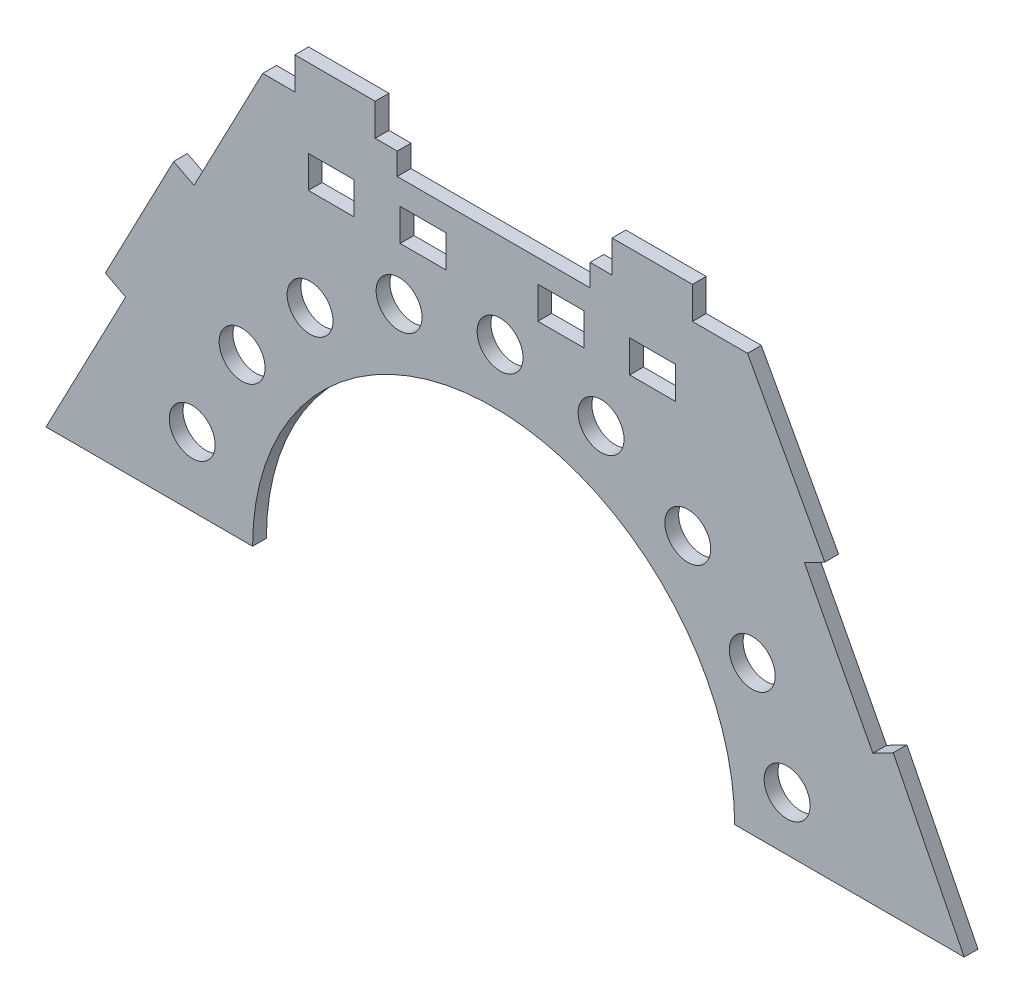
ISO-10303-21;
HEADER;
FILE_DESCRIPTION(('STEP AP214'),'2;1');
FILE_NAME('part.step','',(''),(''),'','','');
FILE_SCHEMA(('AUTOMOTIVE_DESIGN { 1 0 10303 214 1 1 1 1 }'));
ENDSEC;
DATA;
#1=APPLICATION_CONTEXT('core data for automotive mechanical design processes');
#2=APPLICATION_PROTOCOL_DEFINITION('international standard','automotive_design',2000,#1);
#3=PRODUCT_CONTEXT('',#1,'mechanical');
#4=PRODUCT('Part','Part','',(#3));
#5=PRODUCT_RELATED_PRODUCT_CATEGORY('part','',(#4));
#6=PRODUCT_DEFINITION_FORMATION('','',#4);
#7=PRODUCT_DEFINITION_CONTEXT('part definition',#1,'design');
#8=PRODUCT_DEFINITION('design','',#6,#7);
#9=PRODUCT_DEFINITION_SHAPE('','',#8);
#10=(LENGTH_UNIT() NAMED_UNIT(*) SI_UNIT(.MILLI.,.METRE.));
#11=(NAMED_UNIT(*) PLANE_ANGLE_UNIT() SI_UNIT($,.RADIAN.));
#12=(NAMED_UNIT(*) SI_UNIT($,.STERADIAN.) SOLID_ANGLE_UNIT());
#13=UNCERTAINTY_MEASURE_WITH_UNIT(LENGTH_MEASURE(1.E-05),#10,'distance_accuracy_value','');
#14=(GEOMETRIC_REPRESENTATION_CONTEXT(3) GLOBAL_UNCERTAINTY_ASSIGNED_CONTEXT((#13)) GLOBAL_UNIT_ASSIGNED_CONTEXT((#10,
#11,#12)) REPRESENTATION_CONTEXT('',''));
#15=CARTESIAN_POINT('',(0.,0.,0.));
#16=DIRECTION('',(0.,0.,1.));
#17=DIRECTION('',(1.,0.,0.));
#18=AXIS2_PLACEMENT_3D('',#15,#16,#17);
#19=CARTESIAN_POINT('',(0.,80.3787383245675,3.));
#20=DIRECTION('',(0.,1.,0.));
#21=DIRECTION('',(0.,0.,1.));
#22=AXIS2_PLACEMENT_3D('',#19,#20,#21);
#23=PLANE('',#22);
#24=DIRECTION('',(1.,0.,0.));
#25=VECTOR('',#24,1.);
#26=CARTESIAN_POINT('',(0.,80.3787383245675,0.));
#27=LINE('',#26,#25);
#28=CARTESIAN_POINT('',(29.6356661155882,80.3787383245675,0.));
#29=VERTEX_POINT('',#28);
#30=CARTESIAN_POINT('',(39.6356661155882,80.3787383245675,0.));
#31=VERTEX_POINT('',#30);
#32=EDGE_CURVE('E530',#29,#31,#27,.T.);
#33=ORIENTED_EDGE('',*,*,#32,.T.);
#34=DIRECTION('',(0.,0.,-1.));
#35=VECTOR('',#34,1.);
#36=CARTESIAN_POINT('',(39.6356661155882,80.3787383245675,3.));
#37=LINE('',#36,#35);
#38=CARTESIAN_POINT('',(39.6356661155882,80.3787383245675,3.));
#39=VERTEX_POINT('',#38);
#40=EDGE_CURVE('E11',#39,#31,#37,.T.);
#41=ORIENTED_EDGE('',*,*,#40,.F.);
#42=DIRECTION('',(1.,0.,0.));
#43=VECTOR('',#42,1.);
#44=CARTESIAN_POINT('',(0.,80.3787383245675,3.));
#45=LINE('',#44,#43);
#46=CARTESIAN_POINT('',(29.6356661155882,80.3787383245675,3.));
#47=VERTEX_POINT('',#46);
#48=EDGE_CURVE('E330',#47,#39,#45,.T.);
#49=ORIENTED_EDGE('',*,*,#48,.F.);
#50=DIRECTION('',(0.,0.,-1.));
#51=VECTOR('',#50,1.);
#52=CARTESIAN_POINT('',(29.6356661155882,80.3787383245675,3.));
#53=LINE('',#52,#51);
#54=EDGE_CURVE('E65',#47,#29,#53,.T.);
#55=ORIENTED_EDGE('',*,*,#54,.T.);
#56=EDGE_LOOP('',(#33,#41,#49,#55));
#57=FACE_BOUND('',#56,.T.);
#58=ADVANCED_FACE('F45',(#57),#23,.F.);
#59=CARTESIAN_POINT('',(39.6356661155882,0.,3.));
#60=DIRECTION('',(1.,0.,0.));
#61=DIRECTION('',(0.,0.,-1.));
#62=AXIS2_PLACEMENT_3D('',#59,#60,#61);
#63=PLANE('',#62);
#64=DIRECTION('',(0.,-1.,0.));
#65=VECTOR('',#64,1.);
#66=CARTESIAN_POINT('',(39.6356661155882,0.,0.));
#67=LINE('',#66,#65);
#68=CARTESIAN_POINT('',(39.6356661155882,73.3787383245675,0.));
#69=VERTEX_POINT('',#68);
#70=EDGE_CURVE('E337',#31,#69,#67,.T.);
#71=ORIENTED_EDGE('',*,*,#70,.T.);
#72=DIRECTION('',(0.,0.,-1.));
#73=VECTOR('',#72,1.);
#74=CARTESIAN_POINT('',(39.6356661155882,73.3787383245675,3.));
#75=LINE('',#74,#73);
#76=CARTESIAN_POINT('',(39.6356661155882,73.3787383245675,3.));
#77=VERTEX_POINT('',#76);
#78=EDGE_CURVE('E56',#77,#69,#75,.T.);
#79=ORIENTED_EDGE('',*,*,#78,.F.);
#80=DIRECTION('',(0.,-1.,0.));
#81=VECTOR('',#80,1.);
#82=CARTESIAN_POINT('',(39.6356661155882,0.,3.));
#83=LINE('',#82,#81);
#84=EDGE_CURVE('E324',#39,#77,#83,.T.);
#85=ORIENTED_EDGE('',*,*,#84,.F.);
#86=ORIENTED_EDGE('',*,*,#40,.T.);
#87=EDGE_LOOP('',(#71,#79,#85,#86));
#88=FACE_BOUND('',#87,.T.);
#89=ADVANCED_FACE('F336',(#88),#63,.F.);
#90=CARTESIAN_POINT('',(0.,73.3787383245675,3.));
#91=DIRECTION('',(0.,1.,0.));
#92=DIRECTION('',(0.,0.,1.));
#93=AXIS2_PLACEMENT_3D('',#90,#91,#92);
#94=PLANE('',#93);
#95=DIRECTION('',(1.,0.,0.));
#96=VECTOR('',#95,1.);
#97=CARTESIAN_POINT('',(0.,73.3787383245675,0.));
#98=LINE('',#97,#96);
#99=CARTESIAN_POINT('',(29.6356661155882,73.3787383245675,0.));
#100=VERTEX_POINT('',#99);
#101=EDGE_CURVE('E535',#100,#69,#98,.T.);
#102=ORIENTED_EDGE('',*,*,#101,.F.);
#103=DIRECTION('',(0.,0.,-1.));
#104=VECTOR('',#103,1.);
#105=CARTESIAN_POINT('',(29.6356661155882,73.3787383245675,3.));
#106=LINE('',#105,#104);
#107=CARTESIAN_POINT('',(29.6356661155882,73.3787383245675,3.));
#108=VERTEX_POINT('',#107);
#109=EDGE_CURVE('E193',#108,#100,#106,.T.);
#110=ORIENTED_EDGE('',*,*,#109,.F.);
#111=DIRECTION('',(1.,0.,0.));
#112=VECTOR('',#111,1.);
#113=CARTESIAN_POINT('',(0.,73.3787383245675,3.));
#114=LINE('',#113,#112);
#115=EDGE_CURVE('E329',#108,#77,#114,.T.);
#116=ORIENTED_EDGE('',*,*,#115,.T.);
#117=ORIENTED_EDGE('',*,*,#78,.T.);
#118=EDGE_LOOP('',(#102,#110,#116,#117));
#119=FACE_BOUND('',#118,.T.);
#120=ADVANCED_FACE('F342',(#119),#94,.T.);
#121=CARTESIAN_POINT('',(0.,80.5063964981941,3.));
#122=DIRECTION('',(0.,1.,0.));
#123=DIRECTION('',(0.,0.,1.));
#124=AXIS2_PLACEMENT_3D('',#121,#122,#123);
#125=PLANE('',#124);
#126=DIRECTION('',(1.,0.,0.));
#127=VECTOR('',#126,1.);
#128=CARTESIAN_POINT('',(0.,80.5063964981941,0.));
#129=LINE('',#128,#127);
#130=CARTESIAN_POINT('',(9.63566611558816,80.5063964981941,0.));
#131=VERTEX_POINT('',#130);
#132=CARTESIAN_POINT('',(19.6356661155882,80.5063964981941,0.));
#133=VERTEX_POINT('',#132);
#134=EDGE_CURVE('E514',#131,#133,#129,.T.);
#135=ORIENTED_EDGE('',*,*,#134,.T.);
#136=DIRECTION('',(0.,0.,-1.));
#137=VECTOR('',#136,1.);
#138=CARTESIAN_POINT('',(19.6356661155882,80.5063964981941,3.));
#139=LINE('',#138,#137);
#140=CARTESIAN_POINT('',(19.6356661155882,80.5063964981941,3.));
#141=VERTEX_POINT('',#140);
#142=EDGE_CURVE('E545',#141,#133,#139,.T.);
#143=ORIENTED_EDGE('',*,*,#142,.F.);
#144=DIRECTION('',(1.,0.,0.));
#145=VECTOR('',#144,1.);
#146=CARTESIAN_POINT('',(0.,80.5063964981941,3.));
#147=LINE('',#146,#145);
#148=CARTESIAN_POINT('',(9.63566611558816,80.5063964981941,3.));
#149=VERTEX_POINT('',#148);
#150=EDGE_CURVE('E838',#149,#141,#147,.T.);
#151=ORIENTED_EDGE('',*,*,#150,.F.);
#152=DIRECTION('',(0.,0.,-1.));
#153=VECTOR('',#152,1.);
#154=CARTESIAN_POINT('',(9.63566611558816,80.5063964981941,3.));
#155=LINE('',#154,#153);
#156=EDGE_CURVE('E548',#149,#131,#155,.T.);
#157=ORIENTED_EDGE('',*,*,#156,.T.);
#158=EDGE_LOOP('',(#135,#143,#151,#157));
#159=FACE_BOUND('',#158,.T.);
#160=ADVANCED_FACE('F870',(#159),#125,.F.);
#161=CARTESIAN_POINT('',(19.6356661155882,0.,3.));
#162=DIRECTION('',(1.,0.,0.));
#163=DIRECTION('',(0.,0.,-1.));
#164=AXIS2_PLACEMENT_3D('',#161,#162,#163);
#165=PLANE('',#164);
#166=DIRECTION('',(0.,-1.,0.));
#167=VECTOR('',#166,1.);
#168=CARTESIAN_POINT('',(19.6356661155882,0.,0.));
#169=LINE('',#168,#167);
#170=CARTESIAN_POINT('',(19.6356661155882,73.5063964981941,0.));
#171=VERTEX_POINT('',#170);
#172=EDGE_CURVE('E518',#133,#171,#169,.T.);
#173=ORIENTED_EDGE('',*,*,#172,.T.);
#174=DIRECTION('',(0.,0.,-1.));
#175=VECTOR('',#174,1.);
#176=CARTESIAN_POINT('',(19.6356661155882,73.5063964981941,3.));
#177=LINE('',#176,#175);
#178=CARTESIAN_POINT('',(19.6356661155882,73.5063964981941,3.));
#179=VERTEX_POINT('',#178);
#180=EDGE_CURVE('E555',#179,#171,#177,.T.);
#181=ORIENTED_EDGE('',*,*,#180,.F.);
#182=DIRECTION('',(0.,-1.,0.));
#183=VECTOR('',#182,1.);
#184=CARTESIAN_POINT('',(19.6356661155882,0.,3.));
#185=LINE('',#184,#183);
#186=EDGE_CURVE('E842',#141,#179,#185,.T.);
#187=ORIENTED_EDGE('',*,*,#186,.F.);
#188=ORIENTED_EDGE('',*,*,#142,.T.);
#189=EDGE_LOOP('',(#173,#181,#187,#188));
#190=FACE_BOUND('',#189,.T.);
#191=ADVANCED_FACE('F872',(#190),#165,.F.);
#192=CARTESIAN_POINT('',(0.,73.5063964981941,3.));
#193=DIRECTION('',(0.,1.,0.));
#194=DIRECTION('',(0.,0.,1.));
#195=AXIS2_PLACEMENT_3D('',#192,#193,#194);
#196=PLANE('',#195);
#197=DIRECTION('',(1.,0.,0.));
#198=VECTOR('',#197,1.);
#199=CARTESIAN_POINT('',(0.,73.5063964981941,0.));
#200=LINE('',#199,#198);
#201=CARTESIAN_POINT('',(9.63566611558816,73.5063964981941,0.));
#202=VERTEX_POINT('',#201);
#203=EDGE_CURVE('E522',#202,#171,#200,.T.);
#204=ORIENTED_EDGE('',*,*,#203,.F.);
#205=DIRECTION('',(0.,0.,-1.));
#206=VECTOR('',#205,1.);
#207=CARTESIAN_POINT('',(9.63566611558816,73.5063964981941,3.));
#208=LINE('',#207,#206);
#209=CARTESIAN_POINT('',(9.63566611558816,73.5063964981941,3.));
#210=VERTEX_POINT('',#209);
#211=EDGE_CURVE('E551',#210,#202,#208,.T.);
#212=ORIENTED_EDGE('',*,*,#211,.F.);
#213=DIRECTION('',(1.,0.,0.));
#214=VECTOR('',#213,1.);
#215=CARTESIAN_POINT('',(0.,73.5063964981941,3.));
#216=LINE('',#215,#214);
#217=EDGE_CURVE('E845',#210,#179,#216,.T.);
#218=ORIENTED_EDGE('',*,*,#217,.T.);
#219=ORIENTED_EDGE('',*,*,#180,.T.);
#220=EDGE_LOOP('',(#204,#212,#218,#219));
#221=FACE_BOUND('',#220,.T.);
#222=ADVANCED_FACE('F865',(#221),#196,.T.);
#223=CARTESIAN_POINT('',(0.,80.1872510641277,3.));
#224=DIRECTION('',(0.,1.,0.));
#225=DIRECTION('',(0.,0.,1.));
#226=AXIS2_PLACEMENT_3D('',#223,#224,#225);
#227=PLANE('',#226);
#228=DIRECTION('',(1.,0.,0.));
#229=VECTOR('',#228,1.);
#230=CARTESIAN_POINT('',(0.,80.1872510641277,0.));
#231=LINE('',#230,#229);
#232=CARTESIAN_POINT('',(-20.3643338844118,80.1872510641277,0.));
#233=VERTEX_POINT('',#232);
#234=CARTESIAN_POINT('',(-10.3643338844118,80.1872510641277,0.));
#235=VERTEX_POINT('',#234);
#236=EDGE_CURVE('E498',#233,#235,#231,.T.);
#237=ORIENTED_EDGE('',*,*,#236,.T.);
#238=DIRECTION('',(0.,0.,-1.));
#239=VECTOR('',#238,1.);
#240=CARTESIAN_POINT('',(-10.3643338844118,80.1872510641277,3.));
#241=LINE('',#240,#239);
#242=CARTESIAN_POINT('',(-10.3643338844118,80.1872510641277,3.));
#243=VERTEX_POINT('',#242);
#244=EDGE_CURVE('E552',#243,#235,#241,.T.);
#245=ORIENTED_EDGE('',*,*,#244,.F.);
#246=DIRECTION('',(1.,0.,0.));
#247=VECTOR('',#246,1.);
#248=CARTESIAN_POINT('',(0.,80.1872510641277,3.));
#249=LINE('',#248,#247);
#250=CARTESIAN_POINT('',(-20.3643338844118,80.1872510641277,3.));
#251=VERTEX_POINT('',#250);
#252=EDGE_CURVE('E823',#251,#243,#249,.T.);
#253=ORIENTED_EDGE('',*,*,#252,.F.);
#254=DIRECTION('',(0.,0.,-1.));
#255=VECTOR('',#254,1.);
#256=CARTESIAN_POINT('',(-20.3643338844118,80.1872510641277,3.));
#257=LINE('',#256,#255);
#258=EDGE_CURVE('E561',#251,#233,#257,.T.);
#259=ORIENTED_EDGE('',*,*,#258,.T.);
#260=EDGE_LOOP('',(#237,#245,#253,#259));
#261=FACE_BOUND('',#260,.T.);
#262=ADVANCED_FACE('F879',(#261),#227,.F.);
#263=CARTESIAN_POINT('',(-10.3643338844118,0.,3.));
#264=DIRECTION('',(1.,0.,0.));
#265=DIRECTION('',(0.,1.,0.));
#266=AXIS2_PLACEMENT_3D('',#263,#264,#265);
#267=PLANE('',#266);
#268=DIRECTION('',(0.,-1.,0.));
#269=VECTOR('',#268,1.);
#270=CARTESIAN_POINT('',(-10.3643338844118,0.,0.));
#271=LINE('',#270,#269);
#272=CARTESIAN_POINT('',(-10.3643338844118,73.1872510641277,0.));
#273=VERTEX_POINT('',#272);
#274=EDGE_CURVE('E502',#235,#273,#271,.T.);
#275=ORIENTED_EDGE('',*,*,#274,.T.);
#276=DIRECTION('',(0.,0.,-1.));
#277=VECTOR('',#276,1.);
#278=CARTESIAN_POINT('',(-10.3643338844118,73.1872510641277,3.));
#279=LINE('',#278,#277);
#280=CARTESIAN_POINT('',(-10.3643338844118,73.1872510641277,3.));
#281=VERTEX_POINT('',#280);
#282=EDGE_CURVE('E568',#281,#273,#279,.T.);
#283=ORIENTED_EDGE('',*,*,#282,.F.);
#284=DIRECTION('',(0.,-1.,0.));
#285=VECTOR('',#284,1.);
#286=CARTESIAN_POINT('',(-10.3643338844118,0.,3.));
#287=LINE('',#286,#285);
#288=EDGE_CURVE('E827',#243,#281,#287,.T.);
#289=ORIENTED_EDGE('',*,*,#288,.F.);
#290=ORIENTED_EDGE('',*,*,#244,.T.);
#291=EDGE_LOOP('',(#275,#283,#289,#290));
#292=FACE_BOUND('',#291,.T.);
#293=ADVANCED_FACE('F1089',(#292),#267,.F.);
#294=CARTESIAN_POINT('',(0.,73.1872510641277,3.));
#295=DIRECTION('',(0.,1.,0.));
#296=DIRECTION('',(0.,0.,1.));
#297=AXIS2_PLACEMENT_3D('',#294,#295,#296);
#298=PLANE('',#297);
#299=DIRECTION('',(1.,0.,0.));
#300=VECTOR('',#299,1.);
#301=CARTESIAN_POINT('',(0.,73.1872510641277,0.));
#302=LINE('',#301,#300);
#303=CARTESIAN_POINT('',(-20.3643338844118,73.1872510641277,0.));
#304=VERTEX_POINT('',#303);
#305=EDGE_CURVE('E506',#304,#273,#302,.T.);
#306=ORIENTED_EDGE('',*,*,#305,.F.);
#307=DIRECTION('',(0.,0.,-1.));
#308=VECTOR('',#307,1.);
#309=CARTESIAN_POINT('',(-20.3643338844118,73.1872510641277,3.));
#310=LINE('',#309,#308);
#311=CARTESIAN_POINT('',(-20.3643338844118,73.1872510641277,3.));
#312=VERTEX_POINT('',#311);
#313=EDGE_CURVE('E564',#312,#304,#310,.T.);
#314=ORIENTED_EDGE('',*,*,#313,.F.);
#315=DIRECTION('',(1.,0.,0.));
#316=VECTOR('',#315,1.);
#317=CARTESIAN_POINT('',(0.,73.1872510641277,3.));
#318=LINE('',#317,#316);
#319=EDGE_CURVE('E830',#312,#281,#318,.T.);
#320=ORIENTED_EDGE('',*,*,#319,.T.);
#321=ORIENTED_EDGE('',*,*,#282,.T.);
#322=EDGE_LOOP('',(#306,#314,#320,#321));
#323=FACE_BOUND('',#322,.T.);
#324=ADVANCED_FACE('F1013',(#323),#298,.T.);
#325=CARTESIAN_POINT('',(0.,80.1872510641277,3.));
#326=DIRECTION('',(0.,1.,0.));
#327=DIRECTION('',(0.,0.,1.));
#328=AXIS2_PLACEMENT_3D('',#325,#326,#327);
#329=PLANE('',#328);
#330=DIRECTION('',(1.,0.,0.));
#331=VECTOR('',#330,1.);
#332=CARTESIAN_POINT('',(0.,80.1872510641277,0.));
#333=LINE('',#332,#331);
#334=CARTESIAN_POINT('',(-40.364333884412,80.1872510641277,0.));
#335=VERTEX_POINT('',#334);
#336=CARTESIAN_POINT('',(-30.364333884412,80.1872510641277,0.));
#337=VERTEX_POINT('',#336);
#338=EDGE_CURVE('E482',#335,#337,#333,.T.);
#339=ORIENTED_EDGE('',*,*,#338,.T.);
#340=DIRECTION('',(0.,0.,-1.));
#341=VECTOR('',#340,1.);
#342=CARTESIAN_POINT('',(-30.364333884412,80.1872510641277,3.));
#343=LINE('',#342,#341);
#344=CARTESIAN_POINT('',(-30.364333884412,80.1872510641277,3.));
#345=VERTEX_POINT('',#344);
#346=EDGE_CURVE('E565',#345,#337,#343,.T.);
#347=ORIENTED_EDGE('',*,*,#346,.F.);
#348=DIRECTION('',(1.,0.,0.));
#349=VECTOR('',#348,1.);
#350=CARTESIAN_POINT('',(0.,80.1872510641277,3.));
#351=LINE('',#350,#349);
#352=CARTESIAN_POINT('',(-40.364333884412,80.1872510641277,3.));
#353=VERTEX_POINT('',#352);
#354=EDGE_CURVE('E808',#353,#345,#351,.T.);
#355=ORIENTED_EDGE('',*,*,#354,.F.);
#356=DIRECTION('',(0.,0.,-1.));
#357=VECTOR('',#356,1.);
#358=CARTESIAN_POINT('',(-40.364333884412,80.1872510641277,3.));
#359=LINE('',#358,#357);
#360=EDGE_CURVE('E574',#353,#335,#359,.T.);
#361=ORIENTED_EDGE('',*,*,#360,.T.);
#362=EDGE_LOOP('',(#339,#347,#355,#361));
#363=FACE_BOUND('',#362,.T.);
#364=ADVANCED_FACE('F1004',(#363),#329,.F.);
#365=CARTESIAN_POINT('',(-30.364333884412,0.,3.));
#366=DIRECTION('',(1.,0.,0.));
#367=DIRECTION('',(0.,0.,-1.));
#368=AXIS2_PLACEMENT_3D('',#365,#366,#367);
#369=PLANE('',#368);
#370=DIRECTION('',(0.,-1.,0.));
#371=VECTOR('',#370,1.);
#372=CARTESIAN_POINT('',(-30.364333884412,0.,0.));
#373=LINE('',#372,#371);
#374=CARTESIAN_POINT('',(-30.364333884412,73.1872510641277,0.));
#375=VERTEX_POINT('',#374);
#376=EDGE_CURVE('E486',#337,#375,#373,.T.);
#377=ORIENTED_EDGE('',*,*,#376,.T.);
#378=DIRECTION('',(0.,0.,-1.));
#379=VECTOR('',#378,1.);
#380=CARTESIAN_POINT('',(-30.364333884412,73.1872510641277,3.));
#381=LINE('',#380,#379);
#382=CARTESIAN_POINT('',(-30.364333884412,73.1872510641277,3.));
#383=VERTEX_POINT('',#382);
#384=EDGE_CURVE('E580',#383,#375,#381,.T.);
#385=ORIENTED_EDGE('',*,*,#384,.F.);
#386=DIRECTION('',(0.,-1.,0.));
#387=VECTOR('',#386,1.);
#388=CARTESIAN_POINT('',(-30.364333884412,0.,3.));
#389=LINE('',#388,#387);
#390=EDGE_CURVE('E812',#345,#383,#389,.T.);
#391=ORIENTED_EDGE('',*,*,#390,.F.);
#392=ORIENTED_EDGE('',*,*,#346,.T.);
#393=EDGE_LOOP('',(#377,#385,#391,#392));
#394=FACE_BOUND('',#393,.T.);
#395=ADVANCED_FACE('F998',(#394),#369,.F.);
#396=CARTESIAN_POINT('',(0.,73.1872510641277,3.));
#397=DIRECTION('',(0.,1.,0.));
#398=DIRECTION('',(0.,0.,1.));
#399=AXIS2_PLACEMENT_3D('',#396,#397,#398);
#400=PLANE('',#399);
#401=DIRECTION('',(1.,0.,0.));
#402=VECTOR('',#401,1.);
#403=CARTESIAN_POINT('',(0.,73.1872510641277,0.));
#404=LINE('',#403,#402);
#405=CARTESIAN_POINT('',(-40.364333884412,73.1872510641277,0.));
#406=VERTEX_POINT('',#405);
#407=EDGE_CURVE('E490',#406,#375,#404,.T.);
#408=ORIENTED_EDGE('',*,*,#407,.F.);
#409=DIRECTION('',(0.,0.,-1.));
#410=VECTOR('',#409,1.);
#411=CARTESIAN_POINT('',(-40.364333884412,73.1872510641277,3.));
#412=LINE('',#411,#410);
#413=CARTESIAN_POINT('',(-40.364333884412,73.1872510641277,3.));
#414=VERTEX_POINT('',#413);
#415=EDGE_CURVE('E577',#414,#406,#412,.T.);
#416=ORIENTED_EDGE('',*,*,#415,.F.);
#417=DIRECTION('',(1.,0.,0.));
#418=VECTOR('',#417,1.);
#419=CARTESIAN_POINT('',(0.,73.1872510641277,3.));
#420=LINE('',#419,#418);
#421=EDGE_CURVE('E815',#414,#383,#420,.T.);
#422=ORIENTED_EDGE('',*,*,#421,.T.);
#423=ORIENTED_EDGE('',*,*,#384,.T.);
#424=EDGE_LOOP('',(#408,#416,#422,#423));
#425=FACE_BOUND('',#424,.T.);
#426=ADVANCED_FACE('F994',(#425),#400,.T.);
#427=CARTESIAN_POINT('',(11.3199081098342,21.6565191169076,3.));
#428=DIRECTION('',(-0.463236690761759,-0.88623460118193,0.));
#429=DIRECTION('',(0.88623460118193,-0.46323669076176,0.));
#430=AXIS2_PLACEMENT_3D('',#427,#428,#429);
#431=PLANE('',#430);
#432=DIRECTION('',(-0.88623460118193,0.46323669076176,0.));
#433=VECTOR('',#432,1.);
#434=CARTESIAN_POINT('',(11.3199081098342,21.6565191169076,0.));
#435=LINE('',#434,#433);
#436=CARTESIAN_POINT('',(-65.2577393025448,61.6838165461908,0.));
#437=VERTEX_POINT('',#436);
#438=CARTESIAN_POINT('',(-69.6889123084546,63.9999999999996,0.));
#439=VERTEX_POINT('',#438);
#440=EDGE_CURVE('E351',#437,#439,#435,.T.);
#441=ORIENTED_EDGE('',*,*,#440,.T.);
#442=DIRECTION('',(0.,0.,-1.));
#443=VECTOR('',#442,1.);
#444=CARTESIAN_POINT('',(-69.6889123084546,63.9999999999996,3.));
#445=LINE('',#444,#443);
#446=CARTESIAN_POINT('',(-69.6889123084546,63.9999999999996,3.));
#447=VERTEX_POINT('',#446);
#448=EDGE_CURVE('E49',#447,#439,#445,.T.);
#449=ORIENTED_EDGE('',*,*,#448,.F.);
#450=DIRECTION('',(-0.88623460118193,0.46323669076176,0.));
#451=VECTOR('',#450,1.);
#452=CARTESIAN_POINT('',(11.3199081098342,21.6565191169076,3.));
#453=LINE('',#452,#451);
#454=CARTESIAN_POINT('',(-65.2577393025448,61.6838165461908,3.));
#455=VERTEX_POINT('',#454);
#456=EDGE_CURVE('E542',#455,#447,#453,.T.);
#457=ORIENTED_EDGE('',*,*,#456,.F.);
#458=DIRECTION('',(0.,0.,-1.));
#459=VECTOR('',#458,1.);
#460=CARTESIAN_POINT('',(-65.2577393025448,61.6838165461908,3.));
#461=LINE('',#460,#459);
#462=EDGE_CURVE('E347',#455,#437,#461,.T.);
#463=ORIENTED_EDGE('',*,*,#462,.T.);
#464=EDGE_LOOP('',(#441,#449,#457,#463));
#465=FACE_BOUND('',#464,.T.);
#466=ADVANCED_FACE('F47',(#465),#431,.F.);
#467=CARTESIAN_POINT('',(-81.0088204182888,42.3434808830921,3.));
#468=DIRECTION('',(0.886234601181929,-0.46323669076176,0.));
#469=DIRECTION('',(0.46323669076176,0.88623460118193,0.));
#470=AXIS2_PLACEMENT_3D('',#467,#468,#469);
#471=PLANE('',#470);
#472=DIRECTION('',(-0.46323669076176,-0.88623460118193,0.));
#473=VECTOR('',#472,1.);
#474=CARTESIAN_POINT('',(-81.0088204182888,42.3434808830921,0.));
#475=LINE('',#474,#473);
#476=CARTESIAN_POINT('',(-84.5859222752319,35.4999999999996,0.));
#477=VERTEX_POINT('',#476);
#478=EDGE_CURVE('E355',#439,#477,#475,.T.);
#479=ORIENTED_EDGE('',*,*,#478,.T.);
#480=DIRECTION('',(0.,0.,-1.));
#481=VECTOR('',#480,1.);
#482=CARTESIAN_POINT('',(-84.5859222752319,35.4999999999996,3.));
#483=LINE('',#482,#481);
#484=CARTESIAN_POINT('',(-84.5859222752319,35.4999999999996,3.));
#485=VERTEX_POINT('',#484);
#486=EDGE_CURVE('E662',#485,#477,#483,.T.);
#487=ORIENTED_EDGE('',*,*,#486,.F.);
#488=DIRECTION('',(-0.46323669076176,-0.88623460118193,0.));
#489=VECTOR('',#488,1.);
#490=CARTESIAN_POINT('',(-81.0088204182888,42.3434808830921,3.));
#491=LINE('',#490,#489);
#492=EDGE_CURVE('E206',#447,#485,#491,.T.);
#493=ORIENTED_EDGE('',*,*,#492,.F.);
#494=ORIENTED_EDGE('',*,*,#448,.T.);
#495=EDGE_LOOP('',(#479,#487,#493,#494));
#496=FACE_BOUND('',#495,.T.);
#497=ADVANCED_FACE('F669',(#496),#471,.F.);
#498=CARTESIAN_POINT('',(-3.57710185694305,-6.84348088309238,3.));
#499=DIRECTION('',(-0.463236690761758,-0.88623460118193,0.));
#500=DIRECTION('',(0.88623460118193,-0.463236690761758,0.));
#501=AXIS2_PLACEMENT_3D('',#498,#499,#500);
#502=PLANE('',#501);
#503=DIRECTION('',(-0.88623460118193,0.463236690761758,0.));
#504=VECTOR('',#503,1.);
#505=CARTESIAN_POINT('',(-3.57710185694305,-6.84348088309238,0.));
#506=LINE('',#505,#504);
#507=CARTESIAN_POINT('',(-80.1547492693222,33.1838165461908,0.));
#508=VERTEX_POINT('',#507);
#509=EDGE_CURVE('E359',#508,#477,#506,.T.);
#510=ORIENTED_EDGE('',*,*,#509,.F.);
#511=DIRECTION('',(0.,0.,-1.));
#512=VECTOR('',#511,1.);
#513=CARTESIAN_POINT('',(-80.1547492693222,33.1838165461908,3.));
#514=LINE('',#513,#512);
#515=CARTESIAN_POINT('',(-80.1547492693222,33.1838165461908,3.));
#516=VERTEX_POINT('',#515);
#517=EDGE_CURVE('E660',#516,#508,#514,.T.);
#518=ORIENTED_EDGE('',*,*,#517,.F.);
#519=DIRECTION('',(-0.88623460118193,0.463236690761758,0.));
#520=VECTOR('',#519,1.);
#521=CARTESIAN_POINT('',(-3.57710185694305,-6.84348088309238,3.));
#522=LINE('',#521,#520);
#523=EDGE_CURVE('E688',#516,#485,#522,.T.);
#524=ORIENTED_EDGE('',*,*,#523,.T.);
#525=ORIENTED_EDGE('',*,*,#486,.T.);
#526=EDGE_LOOP('',(#510,#518,#524,#525));
#527=FACE_BOUND('',#526,.T.);
#528=ADVANCED_FACE('F988',(#527),#502,.T.);
#529=CARTESIAN_POINT('',(-76.577647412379,40.0272974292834,3.));
#530=DIRECTION('',(-0.886234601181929,0.463236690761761,0.));
#531=DIRECTION('',(-0.463236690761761,-0.886234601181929,0.));
#532=AXIS2_PLACEMENT_3D('',#529,#530,#531);
#533=PLANE('',#532);
#534=DIRECTION('',(0.463236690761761,0.886234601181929,0.));
#535=VECTOR('',#534,1.);
#536=CARTESIAN_POINT('',(-76.577647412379,40.0272974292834,0.));
#537=LINE('',#536,#535);
#538=CARTESIAN_POINT('',(-97.5,0.,0.));
#539=VERTEX_POINT('',#538);
#540=EDGE_CURVE('E363',#539,#508,#537,.T.);
#541=ORIENTED_EDGE('',*,*,#540,.F.);
#542=DIRECTION('',(0.,0.,-1.));
#543=VECTOR('',#542,1.);
#544=CARTESIAN_POINT('',(-97.5,0.,3.));
#545=LINE('',#544,#543);
#546=CARTESIAN_POINT('',(-97.5,0.,3.));
#547=VERTEX_POINT('',#546);
#548=EDGE_CURVE('E657',#547,#539,#545,.T.);
#549=ORIENTED_EDGE('',*,*,#548,.F.);
#550=DIRECTION('',(0.463236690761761,0.886234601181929,0.));
#551=VECTOR('',#550,1.);
#552=CARTESIAN_POINT('',(-76.577647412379,40.0272974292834,3.));
#553=LINE('',#552,#551);
#554=EDGE_CURVE('E691',#547,#516,#553,.T.);
#555=ORIENTED_EDGE('',*,*,#554,.T.);
#556=ORIENTED_EDGE('',*,*,#517,.T.);
#557=EDGE_LOOP('',(#541,#549,#555,#556));
#558=FACE_BOUND('',#557,.T.);
#559=ADVANCED_FACE('F986',(#558),#533,.T.);
#560=CARTESIAN_POINT('',(0.,0.,3.));
#561=DIRECTION('',(0.,-1.,0.));
#562=DIRECTION('',(1.,0.,0.));
#563=AXIS2_PLACEMENT_3D('',#560,#561,#562);
#564=PLANE('',#563);
#565=DIRECTION('',(-1.,0.,0.));
#566=VECTOR('',#565,1.);
#567=CARTESIAN_POINT('',(0.,0.,0.));
#568=LINE('',#567,#566);
#569=CARTESIAN_POINT('',(-52.5,0.,0.));
#570=VERTEX_POINT('',#569);
#571=EDGE_CURVE('E367',#570,#539,#568,.T.);
#572=ORIENTED_EDGE('',*,*,#571,.F.);
#573=DIRECTION('',(0.,0.,-1.));
#574=VECTOR('',#573,1.);
#575=CARTESIAN_POINT('',(-52.5,0.,3.));
#576=LINE('',#575,#574);
#577=CARTESIAN_POINT('',(-52.5,0.,3.));
#578=VERTEX_POINT('',#577);
#579=EDGE_CURVE('E654',#578,#570,#576,.T.);
#580=ORIENTED_EDGE('',*,*,#579,.F.);
#581=DIRECTION('',(-1.,0.,0.));
#582=VECTOR('',#581,1.);
#583=CARTESIAN_POINT('',(0.,0.,3.));
#584=LINE('',#583,#582);
#585=EDGE_CURVE('E695',#578,#547,#584,.T.);
#586=ORIENTED_EDGE('',*,*,#585,.T.);
#587=ORIENTED_EDGE('',*,*,#548,.T.);
#588=EDGE_LOOP('',(#572,#580,#586,#587));
#589=FACE_BOUND('',#588,.T.);
#590=ADVANCED_FACE('F982',(#589),#564,.T.);
#591=CARTESIAN_POINT('',(0.,0.,3.));
#592=DIRECTION('',(0.,0.,-1.));
#593=DIRECTION('',(-1.,0.,0.));
#594=AXIS2_PLACEMENT_3D('',#591,#592,#593);
#595=CYLINDRICAL_SURFACE('',#594,52.5);
#596=CARTESIAN_POINT('',(0.,0.,0.));
#597=DIRECTION('',(0.,0.,1.));
#598=DIRECTION('',(1.,0.,0.));
#599=AXIS2_PLACEMENT_3D('',#596,#597,#598);
#600=CIRCLE('',#599,52.5);
#601=CARTESIAN_POINT('',(52.5,0.,0.));
#602=VERTEX_POINT('',#601);
#603=EDGE_CURVE('E372',#602,#570,#600,.T.);
#604=ORIENTED_EDGE('',*,*,#603,.F.);
#605=DIRECTION('',(0.,0.,-1.));
#606=VECTOR('',#605,1.);
#607=CARTESIAN_POINT('',(52.5,0.,3.));
#608=LINE('',#607,#606);
#609=CARTESIAN_POINT('',(52.5,0.,3.));
#610=VERTEX_POINT('',#609);
#611=EDGE_CURVE('E651',#610,#602,#608,.T.);
#612=ORIENTED_EDGE('',*,*,#611,.F.);
#613=CARTESIAN_POINT('',(0.,0.,3.));
#614=DIRECTION('',(0.,0.,1.));
#615=DIRECTION('',(1.,0.,0.));
#616=AXIS2_PLACEMENT_3D('',#613,#614,#615);
#617=CIRCLE('',#616,52.5);
#618=EDGE_CURVE('E700',#610,#578,#617,.T.);
#619=ORIENTED_EDGE('',*,*,#618,.T.);
#620=ORIENTED_EDGE('',*,*,#579,.T.);
#621=EDGE_LOOP('',(#604,#612,#619,#620));
#622=FACE_BOUND('',#621,.T.);
#623=ADVANCED_FACE('F978',(#622),#595,.F.);
#624=CARTESIAN_POINT('',(0.,0.,3.));
#625=DIRECTION('',(0.,1.,0.));
#626=DIRECTION('',(0.,0.,1.));
#627=AXIS2_PLACEMENT_3D('',#624,#625,#626);
#628=PLANE('',#627);
#629=DIRECTION('',(1.,0.,0.));
#630=VECTOR('',#629,1.);
#631=CARTESIAN_POINT('',(0.,0.,0.));
#632=LINE('',#631,#630);
#633=CARTESIAN_POINT('',(102.5,0.,0.));
#634=VERTEX_POINT('',#633);
#635=EDGE_CURVE('E376',#602,#634,#632,.T.);
#636=ORIENTED_EDGE('',*,*,#635,.T.);
#637=DIRECTION('',(0.,0.,-1.));
#638=VECTOR('',#637,1.);
#639=CARTESIAN_POINT('',(102.5,0.,3.));
#640=LINE('',#639,#638);
#641=CARTESIAN_POINT('',(102.5,0.,3.));
#642=VERTEX_POINT('',#641);
#643=EDGE_CURVE('E648',#642,#634,#640,.T.);
#644=ORIENTED_EDGE('',*,*,#643,.F.);
#645=DIRECTION('',(1.,0.,0.));
#646=VECTOR('',#645,1.);
#647=CARTESIAN_POINT('',(0.,0.,3.));
#648=LINE('',#647,#646);
#649=EDGE_CURVE('E704',#610,#642,#648,.T.);
#650=ORIENTED_EDGE('',*,*,#649,.F.);
#651=ORIENTED_EDGE('',*,*,#611,.T.);
#652=EDGE_LOOP('',(#636,#644,#650,#651));
#653=FACE_BOUND('',#652,.T.);
#654=ADVANCED_FACE('F974',(#653),#628,.F.);
#655=CARTESIAN_POINT('',(81.877029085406,41.0919406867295,3.));
#656=DIRECTION('',(0.893756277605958,0.448552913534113,0.));
#657=DIRECTION('',(-0.448552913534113,0.893756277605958,0.));
#658=AXIS2_PLACEMENT_3D('',#655,#656,#657);
#659=PLANE('',#658);
#660=DIRECTION('',(0.448552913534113,-0.893756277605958,0.));
#661=VECTOR('',#660,1.);
#662=CARTESIAN_POINT('',(81.877029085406,41.0919406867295,0.));
#663=LINE('',#662,#661);
#664=CARTESIAN_POINT('',(87.0341630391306,30.816183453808,0.));
#665=VERTEX_POINT('',#664);
#666=EDGE_CURVE('E380',#665,#634,#663,.T.);
#667=ORIENTED_EDGE('',*,*,#666,.F.);
#668=DIRECTION('',(0.,0.,-1.));
#669=VECTOR('',#668,1.);
#670=CARTESIAN_POINT('',(87.0341630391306,30.816183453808,3.));
#671=LINE('',#670,#669);
#672=CARTESIAN_POINT('',(87.0341630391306,30.816183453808,3.));
#673=VERTEX_POINT('',#672);
#674=EDGE_CURVE('E645',#673,#665,#671,.T.);
#675=ORIENTED_EDGE('',*,*,#674,.F.);
#676=DIRECTION('',(0.448552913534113,-0.893756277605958,0.));
#677=VECTOR('',#676,1.);
#678=CARTESIAN_POINT('',(81.877029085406,41.0919406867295,3.));
#679=LINE('',#678,#677);
#680=EDGE_CURVE('E707',#673,#642,#679,.T.);
#681=ORIENTED_EDGE('',*,*,#680,.T.);
#682=ORIENTED_EDGE('',*,*,#643,.T.);
#683=EDGE_LOOP('',(#667,#675,#681,#682));
#684=FACE_BOUND('',#683,.T.);
#685=ADVANCED_FACE('F970',(#684),#659,.T.);
#686=CARTESIAN_POINT('',(6.02534262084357,-11.5272974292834,3.));
#687=DIRECTION('',(-0.463236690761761,0.886234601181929,0.));
#688=DIRECTION('',(-0.886234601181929,-0.463236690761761,0.));
#689=AXIS2_PLACEMENT_3D('',#686,#687,#688);
#690=PLANE('',#689);
#691=DIRECTION('',(0.886234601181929,0.463236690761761,0.));
#692=VECTOR('',#691,1.);
#693=CARTESIAN_POINT('',(6.02534262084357,-11.5272974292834,0.));
#694=LINE('',#693,#692);
#695=CARTESIAN_POINT('',(82.6029900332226,28.5,0.));
#696=VERTEX_POINT('',#695);
#697=EDGE_CURVE('E384',#696,#665,#694,.T.);
#698=ORIENTED_EDGE('',*,*,#697,.F.);
#699=DIRECTION('',(0.,0.,-1.));
#700=VECTOR('',#699,1.);
#701=CARTESIAN_POINT('',(82.6029900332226,28.5,3.));
#702=LINE('',#701,#700);
#703=CARTESIAN_POINT('',(82.6029900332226,28.5,3.));
#704=VERTEX_POINT('',#703);
#705=EDGE_CURVE('E642',#704,#696,#702,.T.);
#706=ORIENTED_EDGE('',*,*,#705,.F.);
#707=DIRECTION('',(0.886234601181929,0.463236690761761,0.));
#708=VECTOR('',#707,1.);
#709=CARTESIAN_POINT('',(6.02534262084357,-11.5272974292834,3.));
#710=LINE('',#709,#708);
#711=EDGE_CURVE('E711',#704,#673,#710,.T.);
#712=ORIENTED_EDGE('',*,*,#711,.T.);
#713=ORIENTED_EDGE('',*,*,#674,.T.);
#714=EDGE_LOOP('',(#698,#706,#712,#713));
#715=FACE_BOUND('',#714,.T.);
#716=ADVANCED_FACE('F966',(#715),#690,.T.);
#717=CARTESIAN_POINT('',(76.577647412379,40.0272974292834,3.));
#718=DIRECTION('',(-0.886234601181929,-0.463236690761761,0.));
#719=DIRECTION('',(0.463236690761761,-0.886234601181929,0.));
#720=AXIS2_PLACEMENT_3D('',#717,#718,#719);
#721=PLANE('',#720);
#722=DIRECTION('',(-0.463236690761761,0.886234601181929,0.));
#723=VECTOR('',#722,1.);
#724=CARTESIAN_POINT('',(76.577647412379,40.0272974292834,0.));
#725=LINE('',#724,#723);
#726=CARTESIAN_POINT('',(67.7059800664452,57.0000000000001,0.));
#727=VERTEX_POINT('',#726);
#728=EDGE_CURVE('E388',#696,#727,#725,.T.);
#729=ORIENTED_EDGE('',*,*,#728,.T.);
#730=DIRECTION('',(0.,0.,-1.));
#731=VECTOR('',#730,1.);
#732=CARTESIAN_POINT('',(67.7059800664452,57.0000000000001,3.));
#733=LINE('',#732,#731);
#734=CARTESIAN_POINT('',(67.7059800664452,57.0000000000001,3.));
#735=VERTEX_POINT('',#734);
#736=EDGE_CURVE('E638',#735,#727,#733,.T.);
#737=ORIENTED_EDGE('',*,*,#736,.F.);
#738=DIRECTION('',(-0.463236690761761,0.886234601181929,0.));
#739=VECTOR('',#738,1.);
#740=CARTESIAN_POINT('',(76.577647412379,40.0272974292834,3.));
#741=LINE('',#740,#739);
#742=EDGE_CURVE('E715',#704,#735,#741,.T.);
#743=ORIENTED_EDGE('',*,*,#742,.F.);
#744=ORIENTED_EDGE('',*,*,#705,.T.);
#745=EDGE_LOOP('',(#729,#737,#743,#744));
#746=FACE_BOUND('',#745,.T.);
#747=ADVANCED_FACE('F962',(#746),#721,.F.);
#748=CARTESIAN_POINT('',(-8.87166734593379,16.9727025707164,3.));
#749=DIRECTION('',(-0.463236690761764,0.886234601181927,0.));
#750=DIRECTION('',(-0.886234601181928,-0.463236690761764,0.));
#751=AXIS2_PLACEMENT_3D('',#748,#749,#750);
#752=PLANE('',#751);
#753=DIRECTION('',(0.886234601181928,0.463236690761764,0.));
#754=VECTOR('',#753,1.);
#755=CARTESIAN_POINT('',(-8.87166734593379,16.9727025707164,0.));
#756=LINE('',#755,#754);
#757=CARTESIAN_POINT('',(72.1371530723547,59.3161834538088,0.));
#758=VERTEX_POINT('',#757);
#759=EDGE_CURVE('E391',#727,#758,#756,.T.);
#760=ORIENTED_EDGE('',*,*,#759,.T.);
#761=DIRECTION('',(0.,0.,-1.));
#762=VECTOR('',#761,1.);
#763=CARTESIAN_POINT('',(72.1371530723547,59.3161834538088,3.));
#764=LINE('',#763,#762);
#765=CARTESIAN_POINT('',(72.1371530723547,59.3161834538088,3.));
#766=VERTEX_POINT('',#765);
#767=EDGE_CURVE('E635',#766,#758,#764,.T.);
#768=ORIENTED_EDGE('',*,*,#767,.F.);
#769=DIRECTION('',(0.886234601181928,0.463236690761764,0.));
#770=VECTOR('',#769,1.);
#771=CARTESIAN_POINT('',(-8.87166734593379,16.9727025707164,3.));
#772=LINE('',#771,#770);
#773=EDGE_CURVE('E718',#735,#766,#772,.T.);
#774=ORIENTED_EDGE('',*,*,#773,.F.);
#775=ORIENTED_EDGE('',*,*,#736,.T.);
#776=EDGE_LOOP('',(#760,#768,#774,#775));
#777=FACE_BOUND('',#776,.T.);
#778=ADVANCED_FACE('F958',(#777),#752,.F.);
#779=CARTESIAN_POINT('',(80.5762316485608,43.7865472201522,3.));
#780=DIRECTION('',(0.878646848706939,0.477472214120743,0.));
#781=DIRECTION('',(-0.477472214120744,0.878646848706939,0.));
#782=AXIS2_PLACEMENT_3D('',#779,#780,#781);
#783=PLANE('',#782);
#784=DIRECTION('',(0.477472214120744,-0.878646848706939,0.));
#785=VECTOR('',#784,1.);
#786=CARTESIAN_POINT('',(80.5762316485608,43.7865472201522,0.));
#787=LINE('',#786,#785);
#788=CARTESIAN_POINT('',(55.3,90.3,0.));
#789=VERTEX_POINT('',#788);
#790=EDGE_CURVE('E395',#789,#758,#787,.T.);
#791=ORIENTED_EDGE('',*,*,#790,.F.);
#792=DIRECTION('',(0.,0.,-1.));
#793=VECTOR('',#792,1.);
#794=CARTESIAN_POINT('',(55.3,90.3,3.));
#795=LINE('',#794,#793);
#796=CARTESIAN_POINT('',(55.3,90.3,3.));
#797=VERTEX_POINT('',#796);
#798=EDGE_CURVE('E632',#797,#789,#795,.T.);
#799=ORIENTED_EDGE('',*,*,#798,.F.);
#800=DIRECTION('',(0.477472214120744,-0.878646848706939,0.));
#801=VECTOR('',#800,1.);
#802=CARTESIAN_POINT('',(80.5762316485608,43.7865472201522,3.));
#803=LINE('',#802,#801);
#804=EDGE_CURVE('E721',#797,#766,#803,.T.);
#805=ORIENTED_EDGE('',*,*,#804,.T.);
#806=ORIENTED_EDGE('',*,*,#767,.T.);
#807=EDGE_LOOP('',(#791,#799,#805,#806));
#808=FACE_BOUND('',#807,.T.);
#809=ADVANCED_FACE('F954',(#808),#783,.T.);
#810=CARTESIAN_POINT('',(0.,90.3,3.));
#811=DIRECTION('',(0.,1.,0.));
#812=DIRECTION('',(0.,0.,1.));
#813=AXIS2_PLACEMENT_3D('',#810,#811,#812);
#814=PLANE('',#813);
#815=DIRECTION('',(1.,0.,0.));
#816=VECTOR('',#815,1.);
#817=CARTESIAN_POINT('',(0.,90.3,0.));
#818=LINE('',#817,#816);
#819=CARTESIAN_POINT('',(43.3,90.3,0.));
#820=VERTEX_POINT('',#819);
#821=EDGE_CURVE('E399',#820,#789,#818,.T.);
#822=ORIENTED_EDGE('',*,*,#821,.F.);
#823=DIRECTION('',(0.,0.,-1.));
#824=VECTOR('',#823,1.);
#825=CARTESIAN_POINT('',(43.3,90.3,3.));
#826=LINE('',#825,#824);
#827=CARTESIAN_POINT('',(43.3,90.3,3.));
#828=VERTEX_POINT('',#827);
#829=EDGE_CURVE('E629',#828,#820,#826,.T.);
#830=ORIENTED_EDGE('',*,*,#829,.F.);
#831=DIRECTION('',(1.,0.,0.));
#832=VECTOR('',#831,1.);
#833=CARTESIAN_POINT('',(0.,90.3,3.));
#834=LINE('',#833,#832);
#835=EDGE_CURVE('E725',#828,#797,#834,.T.);
#836=ORIENTED_EDGE('',*,*,#835,.T.);
#837=ORIENTED_EDGE('',*,*,#798,.T.);
#838=EDGE_LOOP('',(#822,#830,#836,#837));
#839=FACE_BOUND('',#838,.T.);
#840=ADVANCED_FACE('F950',(#839),#814,.T.);
#841=CARTESIAN_POINT('',(43.3,0.,3.));
#842=DIRECTION('',(1.,0.,0.));
#843=DIRECTION('',(0.,0.,-1.));
#844=AXIS2_PLACEMENT_3D('',#841,#842,#843);
#845=PLANE('',#844);
#846=DIRECTION('',(0.,-1.,0.));
#847=VECTOR('',#846,1.);
#848=CARTESIAN_POINT('',(43.3,0.,0.));
#849=LINE('',#848,#847);
#850=CARTESIAN_POINT('',(43.3,97.3,0.));
#851=VERTEX_POINT('',#850);
#852=EDGE_CURVE('E403',#851,#820,#849,.T.);
#853=ORIENTED_EDGE('',*,*,#852,.F.);
#854=DIRECTION('',(0.,0.,-1.));
#855=VECTOR('',#854,1.);
#856=CARTESIAN_POINT('',(43.3,97.3,3.));
#857=LINE('',#856,#855);
#858=CARTESIAN_POINT('',(43.3,97.3,3.));
#859=VERTEX_POINT('',#858);
#860=EDGE_CURVE('E626',#859,#851,#857,.T.);
#861=ORIENTED_EDGE('',*,*,#860,.F.);
#862=DIRECTION('',(0.,-1.,0.));
#863=VECTOR('',#862,1.);
#864=CARTESIAN_POINT('',(43.3,0.,3.));
#865=LINE('',#864,#863);
#866=EDGE_CURVE('E729',#859,#828,#865,.T.);
#867=ORIENTED_EDGE('',*,*,#866,.T.);
#868=ORIENTED_EDGE('',*,*,#829,.T.);
#869=EDGE_LOOP('',(#853,#861,#867,#868));
#870=FACE_BOUND('',#869,.T.);
#871=ADVANCED_FACE('F946',(#870),#845,.T.);
#872=CARTESIAN_POINT('',(0.,97.3,3.));
#873=DIRECTION('',(0.,1.,0.));
#874=DIRECTION('',(0.,0.,1.));
#875=AXIS2_PLACEMENT_3D('',#872,#873,#874);
#876=PLANE('',#875);
#877=DIRECTION('',(1.,0.,0.));
#878=VECTOR('',#877,1.);
#879=CARTESIAN_POINT('',(0.,97.3,0.));
#880=LINE('',#879,#878);
#881=CARTESIAN_POINT('',(25.8,97.3,0.));
#882=VERTEX_POINT('',#881);
#883=EDGE_CURVE('E407',#882,#851,#880,.T.);
#884=ORIENTED_EDGE('',*,*,#883,.F.);
#885=DIRECTION('',(0.,0.,-1.));
#886=VECTOR('',#885,1.);
#887=CARTESIAN_POINT('',(25.8,97.3,3.));
#888=LINE('',#887,#886);
#889=CARTESIAN_POINT('',(25.8,97.3,3.));
#890=VERTEX_POINT('',#889);
#891=EDGE_CURVE('E623',#890,#882,#888,.T.);
#892=ORIENTED_EDGE('',*,*,#891,.F.);
#893=DIRECTION('',(1.,0.,0.));
#894=VECTOR('',#893,1.);
#895=CARTESIAN_POINT('',(0.,97.3,3.));
#896=LINE('',#895,#894);
#897=EDGE_CURVE('E733',#890,#859,#896,.T.);
#898=ORIENTED_EDGE('',*,*,#897,.T.);
#899=ORIENTED_EDGE('',*,*,#860,.T.);
#900=EDGE_LOOP('',(#884,#892,#898,#899));
#901=FACE_BOUND('',#900,.T.);
#902=ADVANCED_FACE('F942',(#901),#876,.T.);
#903=CARTESIAN_POINT('',(25.8,0.,3.));
#904=DIRECTION('',(-1.,0.,0.));
#905=DIRECTION('',(0.,0.,1.));
#906=AXIS2_PLACEMENT_3D('',#903,#904,#905);
#907=PLANE('',#906);
#908=DIRECTION('',(0.,1.,0.));
#909=VECTOR('',#908,1.);
#910=CARTESIAN_POINT('',(25.8,0.,0.));
#911=LINE('',#910,#909);
#912=CARTESIAN_POINT('',(25.8,90.3,0.));
#913=VERTEX_POINT('',#912);
#914=EDGE_CURVE('E411',#913,#882,#911,.T.);
#915=ORIENTED_EDGE('',*,*,#914,.F.);
#916=DIRECTION('',(0.,0.,-1.));
#917=VECTOR('',#916,1.);
#918=CARTESIAN_POINT('',(25.8,90.3,3.));
#919=LINE('',#918,#917);
#920=CARTESIAN_POINT('',(25.8,90.3,3.));
#921=VERTEX_POINT('',#920);
#922=EDGE_CURVE('E620',#921,#913,#919,.T.);
#923=ORIENTED_EDGE('',*,*,#922,.F.);
#924=DIRECTION('',(0.,1.,0.));
#925=VECTOR('',#924,1.);
#926=CARTESIAN_POINT('',(25.8,0.,3.));
#927=LINE('',#926,#925);
#928=EDGE_CURVE('E737',#921,#890,#927,.T.);
#929=ORIENTED_EDGE('',*,*,#928,.T.);
#930=ORIENTED_EDGE('',*,*,#891,.T.);
#931=EDGE_LOOP('',(#915,#923,#929,#930));
#932=FACE_BOUND('',#931,.T.);
#933=ADVANCED_FACE('F938',(#932),#907,.T.);
#934=CARTESIAN_POINT('',(0.,90.3,3.));
#935=DIRECTION('',(0.,1.,0.));
#936=DIRECTION('',(0.,0.,1.));
#937=AXIS2_PLACEMENT_3D('',#934,#935,#936);
#938=PLANE('',#937);
#939=DIRECTION('',(1.,0.,0.));
#940=VECTOR('',#939,1.);
#941=CARTESIAN_POINT('',(0.,90.3,0.));
#942=LINE('',#941,#940);
#943=CARTESIAN_POINT('',(21.,90.3,0.));
#944=VERTEX_POINT('',#943);
#945=EDGE_CURVE('E415',#944,#913,#942,.T.);
#946=ORIENTED_EDGE('',*,*,#945,.F.);
#947=DIRECTION('',(0.,0.,-1.));
#948=VECTOR('',#947,1.);
#949=CARTESIAN_POINT('',(21.,90.3,3.));
#950=LINE('',#949,#948);
#951=CARTESIAN_POINT('',(21.,90.3,3.));
#952=VERTEX_POINT('',#951);
#953=EDGE_CURVE('E617',#952,#944,#950,.T.);
#954=ORIENTED_EDGE('',*,*,#953,.F.);
#955=DIRECTION('',(1.,0.,0.));
#956=VECTOR('',#955,1.);
#957=CARTESIAN_POINT('',(0.,90.3,3.));
#958=LINE('',#957,#956);
#959=EDGE_CURVE('E741',#952,#921,#958,.T.);
#960=ORIENTED_EDGE('',*,*,#959,.T.);
#961=ORIENTED_EDGE('',*,*,#922,.T.);
#962=EDGE_LOOP('',(#946,#954,#960,#961));
#963=FACE_BOUND('',#962,.T.);
#964=ADVANCED_FACE('F934',(#963),#938,.T.);
#965=CARTESIAN_POINT('',(21.,0.,3.));
#966=DIRECTION('',(-1.,0.,0.));
#967=DIRECTION('',(0.,0.,1.));
#968=AXIS2_PLACEMENT_3D('',#965,#966,#967);
#969=PLANE('',#968);
#970=DIRECTION('',(0.,1.,0.));
#971=VECTOR('',#970,1.);
#972=CARTESIAN_POINT('',(21.,0.,0.));
#973=LINE('',#972,#971);
#974=CARTESIAN_POINT('',(21.,85.5,0.));
#975=VERTEX_POINT('',#974);
#976=EDGE_CURVE('E419',#975,#944,#973,.T.);
#977=ORIENTED_EDGE('',*,*,#976,.F.);
#978=DIRECTION('',(0.,0.,-1.));
#979=VECTOR('',#978,1.);
#980=CARTESIAN_POINT('',(21.,85.5,3.));
#981=LINE('',#980,#979);
#982=CARTESIAN_POINT('',(21.,85.5,3.));
#983=VERTEX_POINT('',#982);
#984=EDGE_CURVE('E614',#983,#975,#981,.T.);
#985=ORIENTED_EDGE('',*,*,#984,.F.);
#986=DIRECTION('',(0.,1.,0.));
#987=VECTOR('',#986,1.);
#988=CARTESIAN_POINT('',(21.,0.,3.));
#989=LINE('',#988,#987);
#990=EDGE_CURVE('E745',#983,#952,#989,.T.);
#991=ORIENTED_EDGE('',*,*,#990,.T.);
#992=ORIENTED_EDGE('',*,*,#953,.T.);
#993=EDGE_LOOP('',(#977,#985,#991,#992));
#994=FACE_BOUND('',#993,.T.);
#995=ADVANCED_FACE('F930',(#994),#969,.T.);
#996=CARTESIAN_POINT('',(0.,85.5,3.));
#997=DIRECTION('',(0.,1.,0.));
#998=DIRECTION('',(0.,0.,1.));
#999=AXIS2_PLACEMENT_3D('',#996,#997,#998);
#1000=PLANE('',#999);
#1001=DIRECTION('',(1.,0.,0.));
#1002=VECTOR('',#1001,1.);
#1003=CARTESIAN_POINT('',(0.,85.5,0.));
#1004=LINE('',#1003,#1002);
#1005=CARTESIAN_POINT('',(-21.0000000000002,85.5,0.));
#1006=VERTEX_POINT('',#1005);
#1007=EDGE_CURVE('E423',#1006,#975,#1004,.T.);
#1008=ORIENTED_EDGE('',*,*,#1007,.F.);
#1009=DIRECTION('',(0.,0.,-1.));
#1010=VECTOR('',#1009,1.);
#1011=CARTESIAN_POINT('',(-21.0000000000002,85.5,3.));
#1012=LINE('',#1011,#1010);
#1013=CARTESIAN_POINT('',(-21.0000000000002,85.5,3.));
#1014=VERTEX_POINT('',#1013);
#1015=EDGE_CURVE('E611',#1014,#1006,#1012,.T.);
#1016=ORIENTED_EDGE('',*,*,#1015,.F.);
#1017=DIRECTION('',(1.,0.,0.));
#1018=VECTOR('',#1017,1.);
#1019=CARTESIAN_POINT('',(0.,85.5,3.));
#1020=LINE('',#1019,#1018);
#1021=EDGE_CURVE('E749',#1014,#983,#1020,.T.);
#1022=ORIENTED_EDGE('',*,*,#1021,.T.);
#1023=ORIENTED_EDGE('',*,*,#984,.T.);
#1024=EDGE_LOOP('',(#1008,#1016,#1022,#1023));
#1025=FACE_BOUND('',#1024,.T.);
#1026=ADVANCED_FACE('F926',(#1025),#1000,.T.);
#1027=CARTESIAN_POINT('',(-21.0000000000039,9.10729824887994E-13,3.));
#1028=DIRECTION('',(-1.,0.,0.));
#1029=DIRECTION('',(0.,-1.,0.));
#1030=AXIS2_PLACEMENT_3D('',#1027,#1028,#1029);
#1031=PLANE('',#1030);
#1032=DIRECTION('',(0.,1.,0.));
#1033=VECTOR('',#1032,1.);
#1034=CARTESIAN_POINT('',(-21.0000000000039,9.10729824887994E-13,0.));
#1035=LINE('',#1034,#1033);
#1036=CARTESIAN_POINT('',(-21.,90.3,0.));
#1037=VERTEX_POINT('',#1036);
#1038=EDGE_CURVE('E427',#1006,#1037,#1035,.T.);
#1039=ORIENTED_EDGE('',*,*,#1038,.T.);
#1040=DIRECTION('',(0.,0.,-1.));
#1041=VECTOR('',#1040,1.);
#1042=CARTESIAN_POINT('',(-21.,90.3,3.));
#1043=LINE('',#1042,#1041);
#1044=CARTESIAN_POINT('',(-21.,90.3,3.));
#1045=VERTEX_POINT('',#1044);
#1046=EDGE_CURVE('E607',#1045,#1037,#1043,.T.);
#1047=ORIENTED_EDGE('',*,*,#1046,.F.);
#1048=DIRECTION('',(0.,1.,0.));
#1049=VECTOR('',#1048,1.);
#1050=CARTESIAN_POINT('',(-21.0000000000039,9.10729824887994E-13,3.));
#1051=LINE('',#1050,#1049);
#1052=EDGE_CURVE('E753',#1014,#1045,#1051,.T.);
#1053=ORIENTED_EDGE('',*,*,#1052,.F.);
#1054=ORIENTED_EDGE('',*,*,#1015,.T.);
#1055=EDGE_LOOP('',(#1039,#1047,#1053,#1054));
#1056=FACE_BOUND('',#1055,.T.);
#1057=ADVANCED_FACE('F922',(#1056),#1031,.F.);
#1058=CARTESIAN_POINT('',(0.,90.3,3.));
#1059=DIRECTION('',(0.,-1.,0.));
#1060=DIRECTION('',(0.,0.,-1.));
#1061=AXIS2_PLACEMENT_3D('',#1058,#1059,#1060);
#1062=PLANE('',#1061);
#1063=DIRECTION('',(-1.,0.,0.));
#1064=VECTOR('',#1063,1.);
#1065=CARTESIAN_POINT('',(0.,90.3,0.));
#1066=LINE('',#1065,#1064);
#1067=CARTESIAN_POINT('',(-25.8,90.3,0.));
#1068=VERTEX_POINT('',#1067);
#1069=EDGE_CURVE('E430',#1037,#1068,#1066,.T.);
#1070=ORIENTED_EDGE('',*,*,#1069,.T.);
#1071=DIRECTION('',(0.,0.,-1.));
#1072=VECTOR('',#1071,1.);
#1073=CARTESIAN_POINT('',(-25.8,90.3,3.));
#1074=LINE('',#1073,#1072);
#1075=CARTESIAN_POINT('',(-25.8,90.3,3.));
#1076=VERTEX_POINT('',#1075);
#1077=EDGE_CURVE('E603',#1076,#1068,#1074,.T.);
#1078=ORIENTED_EDGE('',*,*,#1077,.F.);
#1079=DIRECTION('',(-1.,0.,0.));
#1080=VECTOR('',#1079,1.);
#1081=CARTESIAN_POINT('',(0.,90.3,3.));
#1082=LINE('',#1081,#1080);
#1083=EDGE_CURVE('E756',#1045,#1076,#1082,.T.);
#1084=ORIENTED_EDGE('',*,*,#1083,.F.);
#1085=ORIENTED_EDGE('',*,*,#1046,.T.);
#1086=EDGE_LOOP('',(#1070,#1078,#1084,#1085));
#1087=FACE_BOUND('',#1086,.T.);
#1088=ADVANCED_FACE('F918',(#1087),#1062,.F.);
#1089=CARTESIAN_POINT('',(-25.8,0.,3.));
#1090=DIRECTION('',(-1.,0.,0.));
#1091=DIRECTION('',(0.,0.,1.));
#1092=AXIS2_PLACEMENT_3D('',#1089,#1090,#1091);
#1093=PLANE('',#1092);
#1094=DIRECTION('',(0.,1.,0.));
#1095=VECTOR('',#1094,1.);
#1096=CARTESIAN_POINT('',(-25.8,0.,0.));
#1097=LINE('',#1096,#1095);
#1098=CARTESIAN_POINT('',(-25.8,97.3,0.));
#1099=VERTEX_POINT('',#1098);
#1100=EDGE_CURVE('E433',#1068,#1099,#1097,.T.);
#1101=ORIENTED_EDGE('',*,*,#1100,.T.);
#1102=DIRECTION('',(0.,0.,-1.));
#1103=VECTOR('',#1102,1.);
#1104=CARTESIAN_POINT('',(-25.8,97.3,3.));
#1105=LINE('',#1104,#1103);
#1106=CARTESIAN_POINT('',(-25.8,97.3,3.));
#1107=VERTEX_POINT('',#1106);
#1108=EDGE_CURVE('E599',#1107,#1099,#1105,.T.);
#1109=ORIENTED_EDGE('',*,*,#1108,.F.);
#1110=DIRECTION('',(0.,1.,0.));
#1111=VECTOR('',#1110,1.);
#1112=CARTESIAN_POINT('',(-25.8,0.,3.));
#1113=LINE('',#1112,#1111);
#1114=EDGE_CURVE('E759',#1076,#1107,#1113,.T.);
#1115=ORIENTED_EDGE('',*,*,#1114,.F.);
#1116=ORIENTED_EDGE('',*,*,#1077,.T.);
#1117=EDGE_LOOP('',(#1101,#1109,#1115,#1116));
#1118=FACE_BOUND('',#1117,.T.);
#1119=ADVANCED_FACE('F914',(#1118),#1093,.F.);
#1120=CARTESIAN_POINT('',(0.,97.3,3.));
#1121=DIRECTION('',(0.,-1.,0.));
#1122=DIRECTION('',(0.,0.,-1.));
#1123=AXIS2_PLACEMENT_3D('',#1120,#1121,#1122);
#1124=PLANE('',#1123);
#1125=DIRECTION('',(-1.,0.,0.));
#1126=VECTOR('',#1125,1.);
#1127=CARTESIAN_POINT('',(0.,97.3,0.));
#1128=LINE('',#1127,#1126);
#1129=CARTESIAN_POINT('',(-43.3,97.3,0.));
#1130=VERTEX_POINT('',#1129);
#1131=EDGE_CURVE('E436',#1099,#1130,#1128,.T.);
#1132=ORIENTED_EDGE('',*,*,#1131,.T.);
#1133=DIRECTION('',(0.,0.,-1.));
#1134=VECTOR('',#1133,1.);
#1135=CARTESIAN_POINT('',(-43.3,97.3,3.));
#1136=LINE('',#1135,#1134);
#1137=CARTESIAN_POINT('',(-43.3,97.3,3.));
#1138=VERTEX_POINT('',#1137);
#1139=EDGE_CURVE('E595',#1138,#1130,#1136,.T.);
#1140=ORIENTED_EDGE('',*,*,#1139,.F.);
#1141=DIRECTION('',(-1.,0.,0.));
#1142=VECTOR('',#1141,1.);
#1143=CARTESIAN_POINT('',(0.,97.3,3.));
#1144=LINE('',#1143,#1142);
#1145=EDGE_CURVE('E762',#1107,#1138,#1144,.T.);
#1146=ORIENTED_EDGE('',*,*,#1145,.F.);
#1147=ORIENTED_EDGE('',*,*,#1108,.T.);
#1148=EDGE_LOOP('',(#1132,#1140,#1146,#1147));
#1149=FACE_BOUND('',#1148,.T.);
#1150=ADVANCED_FACE('F906',(#1149),#1124,.F.);
#1151=CARTESIAN_POINT('',(-43.3,0.,3.));
#1152=DIRECTION('',(1.,0.,0.));
#1153=DIRECTION('',(0.,0.,-1.));
#1154=AXIS2_PLACEMENT_3D('',#1151,#1152,#1153);
#1155=PLANE('',#1154);
#1156=DIRECTION('',(0.,-1.,0.));
#1157=VECTOR('',#1156,1.);
#1158=CARTESIAN_POINT('',(-43.3,0.,0.));
#1159=LINE('',#1158,#1157);
#1160=CARTESIAN_POINT('',(-43.3,90.3,0.));
#1161=VERTEX_POINT('',#1160);
#1162=EDGE_CURVE('E439',#1130,#1161,#1159,.T.);
#1163=ORIENTED_EDGE('',*,*,#1162,.T.);
#1164=DIRECTION('',(0.,0.,-1.));
#1165=VECTOR('',#1164,1.);
#1166=CARTESIAN_POINT('',(-43.3,90.3,3.));
#1167=LINE('',#1166,#1165);
#1168=CARTESIAN_POINT('',(-43.3,90.3,3.));
#1169=VERTEX_POINT('',#1168);
#1170=EDGE_CURVE('E591',#1169,#1161,#1167,.T.);
#1171=ORIENTED_EDGE('',*,*,#1170,.F.);
#1172=DIRECTION('',(0.,-1.,0.));
#1173=VECTOR('',#1172,1.);
#1174=CARTESIAN_POINT('',(-43.3,0.,3.));
#1175=LINE('',#1174,#1173);
#1176=EDGE_CURVE('E765',#1138,#1169,#1175,.T.);
#1177=ORIENTED_EDGE('',*,*,#1176,.F.);
#1178=ORIENTED_EDGE('',*,*,#1139,.T.);
#1179=EDGE_LOOP('',(#1163,#1171,#1177,#1178));
#1180=FACE_BOUND('',#1179,.T.);
#1181=ADVANCED_FACE('F900',(#1180),#1155,.F.);
#1182=CARTESIAN_POINT('',(0.,90.3,3.));
#1183=DIRECTION('',(0.,-1.,0.));
#1184=DIRECTION('',(0.,0.,-1.));
#1185=AXIS2_PLACEMENT_3D('',#1182,#1183,#1184);
#1186=PLANE('',#1185);
#1187=DIRECTION('',(-1.,0.,0.));
#1188=VECTOR('',#1187,1.);
#1189=CARTESIAN_POINT('',(0.,90.3,0.));
#1190=LINE('',#1189,#1188);
#1191=CARTESIAN_POINT('',(-50.3,90.3,0.));
#1192=VERTEX_POINT('',#1191);
#1193=EDGE_CURVE('E442',#1161,#1192,#1190,.T.);
#1194=ORIENTED_EDGE('',*,*,#1193,.T.);
#1195=DIRECTION('',(0.,0.,-1.));
#1196=VECTOR('',#1195,1.);
#1197=CARTESIAN_POINT('',(-50.3,90.3,3.));
#1198=LINE('',#1197,#1196);
#1199=CARTESIAN_POINT('',(-50.3,90.3,3.));
#1200=VERTEX_POINT('',#1199);
#1201=EDGE_CURVE('E588',#1200,#1192,#1198,.T.);
#1202=ORIENTED_EDGE('',*,*,#1201,.F.);
#1203=DIRECTION('',(-1.,0.,0.));
#1204=VECTOR('',#1203,1.);
#1205=CARTESIAN_POINT('',(0.,90.3,3.));
#1206=LINE('',#1205,#1204);
#1207=EDGE_CURVE('E768',#1169,#1200,#1206,.T.);
#1208=ORIENTED_EDGE('',*,*,#1207,.F.);
#1209=ORIENTED_EDGE('',*,*,#1170,.T.);
#1210=EDGE_LOOP('',(#1194,#1202,#1208,#1209));
#1211=FACE_BOUND('',#1210,.T.);
#1212=ADVANCED_FACE('F892',(#1211),#1186,.F.);
#1213=CARTESIAN_POINT('',(9.63566611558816,0.,3.));
#1214=DIRECTION('',(1.,0.,0.));
#1215=DIRECTION('',(0.,0.,-1.));
#1216=AXIS2_PLACEMENT_3D('',#1213,#1214,#1215);
#1217=PLANE('',#1216);
#1218=DIRECTION('',(0.,-1.,0.));
#1219=VECTOR('',#1218,1.);
#1220=CARTESIAN_POINT('',(9.63566611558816,0.,0.));
#1221=LINE('',#1220,#1219);
#1222=EDGE_CURVE('E526',#131,#202,#1221,.T.);
#1223=ORIENTED_EDGE('',*,*,#1222,.F.);
#1224=ORIENTED_EDGE('',*,*,#156,.F.);
#1225=DIRECTION('',(0.,-1.,0.));
#1226=VECTOR('',#1225,1.);
#1227=CARTESIAN_POINT('',(9.63566611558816,0.,3.));
#1228=LINE('',#1227,#1226);
#1229=EDGE_CURVE('E849',#149,#210,#1228,.T.);
#1230=ORIENTED_EDGE('',*,*,#1229,.T.);
#1231=ORIENTED_EDGE('',*,*,#211,.T.);
#1232=EDGE_LOOP('',(#1223,#1224,#1230,#1231));
#1233=FACE_BOUND('',#1232,.T.);
#1234=ADVANCED_FACE('F857',(#1233),#1217,.T.);
#1235=CARTESIAN_POINT('',(-20.3643338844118,0.,3.));
#1236=DIRECTION('',(1.,0.,0.));
#1237=DIRECTION('',(0.,0.,-1.));
#1238=AXIS2_PLACEMENT_3D('',#1235,#1236,#1237);
#1239=PLANE('',#1238);
#1240=DIRECTION('',(0.,-1.,0.));
#1241=VECTOR('',#1240,1.);
#1242=CARTESIAN_POINT('',(-20.3643338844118,0.,0.));
#1243=LINE('',#1242,#1241);
#1244=EDGE_CURVE('E510',#233,#304,#1243,.T.);
#1245=ORIENTED_EDGE('',*,*,#1244,.F.);
#1246=ORIENTED_EDGE('',*,*,#258,.F.);
#1247=DIRECTION('',(0.,-1.,0.));
#1248=VECTOR('',#1247,1.);
#1249=CARTESIAN_POINT('',(-20.3643338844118,0.,3.));
#1250=LINE('',#1249,#1248);
#1251=EDGE_CURVE('E834',#251,#312,#1250,.T.);
#1252=ORIENTED_EDGE('',*,*,#1251,.T.);
#1253=ORIENTED_EDGE('',*,*,#313,.T.);
#1254=EDGE_LOOP('',(#1245,#1246,#1252,#1253));
#1255=FACE_BOUND('',#1254,.T.);
#1256=ADVANCED_FACE('F891',(#1255),#1239,.T.);
#1257=CARTESIAN_POINT('',(-40.364333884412,0.,3.));
#1258=DIRECTION('',(1.,0.,0.));
#1259=DIRECTION('',(0.,1.,0.));
#1260=AXIS2_PLACEMENT_3D('',#1257,#1258,#1259);
#1261=PLANE('',#1260);
#1262=DIRECTION('',(0.,-1.,0.));
#1263=VECTOR('',#1262,1.);
#1264=CARTESIAN_POINT('',(-40.364333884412,0.,0.));
#1265=LINE('',#1264,#1263);
#1266=EDGE_CURVE('E494',#335,#406,#1265,.T.);
#1267=ORIENTED_EDGE('',*,*,#1266,.F.);
#1268=ORIENTED_EDGE('',*,*,#360,.F.);
#1269=DIRECTION('',(0.,-1.,0.));
#1270=VECTOR('',#1269,1.);
#1271=CARTESIAN_POINT('',(-40.364333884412,0.,3.));
#1272=LINE('',#1271,#1270);
#1273=EDGE_CURVE('E819',#353,#414,#1272,.T.);
#1274=ORIENTED_EDGE('',*,*,#1273,.T.);
#1275=ORIENTED_EDGE('',*,*,#415,.T.);
#1276=EDGE_LOOP('',(#1267,#1268,#1274,#1275));
#1277=FACE_BOUND('',#1276,.T.);
#1278=ADVANCED_FACE('F897',(#1277),#1261,.T.);
#1279=CARTESIAN_POINT('',(-65.6585716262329,15.,3.));
#1280=DIRECTION('',(0.,0.,-1.));
#1281=DIRECTION('',(-1.,0.,0.));
#1282=AXIS2_PLACEMENT_3D('',#1279,#1280,#1281);
#1283=CYLINDRICAL_SURFACE('',#1282,4.99999999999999);
#1284=CARTESIAN_POINT('',(-65.6585716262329,15.,3.));
#1285=DIRECTION('',(0.,0.,1.));
#1286=DIRECTION('',(1.,0.,0.));
#1287=AXIS2_PLACEMENT_3D('',#1284,#1285,#1286);
#1288=CIRCLE('',#1287,4.99999999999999);
#1289=CARTESIAN_POINT('',(-60.6585716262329,15.,3.));
#1290=VERTEX_POINT('',#1289);
#1291=EDGE_CURVE('E804',#1290,#1290,#1288,.T.);
#1292=ORIENTED_EDGE('',*,*,#1291,.T.);
#1293=EDGE_LOOP('',(#1292));
#1294=FACE_BOUND('',#1293,.T.);
#1295=CARTESIAN_POINT('',(-65.6585716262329,15.,0.));
#1296=DIRECTION('',(0.,0.,1.));
#1297=DIRECTION('',(1.,0.,0.));
#1298=AXIS2_PLACEMENT_3D('',#1295,#1296,#1297);
#1299=CIRCLE('',#1298,4.99999999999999);
#1300=CARTESIAN_POINT('',(-60.6585716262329,15.,0.));
#1301=VERTEX_POINT('',#1300);
#1302=EDGE_CURVE('E478',#1301,#1301,#1299,.T.);
#1303=ORIENTED_EDGE('',*,*,#1302,.F.);
#1304=EDGE_LOOP('',(#1303));
#1305=FACE_BOUND('',#1304,.T.);
#1306=ADVANCED_FACE('F1015',(#1294,#1305),#1283,.F.);
#1307=CARTESIAN_POINT('',(-54.7870305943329,34.9768677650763,3.));
#1308=DIRECTION('',(0.,0.,-1.));
#1309=DIRECTION('',(-1.,0.,0.));
#1310=AXIS2_PLACEMENT_3D('',#1307,#1308,#1309);
#1311=CYLINDRICAL_SURFACE('',#1310,5.);
#1312=CARTESIAN_POINT('',(-54.7870305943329,34.9768677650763,3.));
#1313=DIRECTION('',(0.,0.,1.));
#1314=DIRECTION('',(1.,0.,0.));
#1315=AXIS2_PLACEMENT_3D('',#1312,#1313,#1314);
#1316=CIRCLE('',#1315,5.);
#1317=CARTESIAN_POINT('',(-49.7870305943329,34.9768677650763,3.));
#1318=VERTEX_POINT('',#1317);
#1319=EDGE_CURVE('E800',#1318,#1318,#1316,.T.);
#1320=ORIENTED_EDGE('',*,*,#1319,.T.);
#1321=EDGE_LOOP('',(#1320));
#1322=FACE_BOUND('',#1321,.T.);
#1323=CARTESIAN_POINT('',(-54.7870305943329,34.9768677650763,0.));
#1324=DIRECTION('',(0.,0.,1.));
#1325=DIRECTION('',(1.,0.,0.));
#1326=AXIS2_PLACEMENT_3D('',#1323,#1324,#1325);
#1327=CIRCLE('',#1326,5.);
#1328=CARTESIAN_POINT('',(-49.7870305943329,34.9768677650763,0.));
#1329=VERTEX_POINT('',#1328);
#1330=EDGE_CURVE('E474',#1329,#1329,#1327,.T.);
#1331=ORIENTED_EDGE('',*,*,#1330,.F.);
#1332=EDGE_LOOP('',(#1331));
#1333=FACE_BOUND('',#1332,.T.);
#1334=ADVANCED_FACE('F1018',(#1322,#1333),#1311,.F.);
#1335=CARTESIAN_POINT('',(-39.9813593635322,51.2493014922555,3.));
#1336=DIRECTION('',(0.,0.,-1.));
#1337=DIRECTION('',(-1.,0.,0.));
#1338=AXIS2_PLACEMENT_3D('',#1335,#1336,#1337);
#1339=CYLINDRICAL_SURFACE('',#1338,5.);
#1340=CARTESIAN_POINT('',(-39.9813593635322,51.2493014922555,3.));
#1341=DIRECTION('',(0.,0.,1.));
#1342=DIRECTION('',(1.,0.,0.));
#1343=AXIS2_PLACEMENT_3D('',#1340,#1341,#1342);
#1344=CIRCLE('',#1343,5.);
#1345=CARTESIAN_POINT('',(-34.9813593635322,51.2493014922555,3.));
#1346=VERTEX_POINT('',#1345);
#1347=EDGE_CURVE('E796',#1346,#1346,#1344,.T.);
#1348=ORIENTED_EDGE('',*,*,#1347,.T.);
#1349=EDGE_LOOP('',(#1348));
#1350=FACE_BOUND('',#1349,.T.);
#1351=CARTESIAN_POINT('',(-39.9813593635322,51.2493014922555,0.));
#1352=DIRECTION('',(0.,0.,1.));
#1353=DIRECTION('',(1.,0.,0.));
#1354=AXIS2_PLACEMENT_3D('',#1351,#1352,#1353);
#1355=CIRCLE('',#1354,5.);
#1356=CARTESIAN_POINT('',(-34.9813593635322,51.2493014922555,0.));
#1357=VERTEX_POINT('',#1356);
#1358=EDGE_CURVE('E470',#1357,#1357,#1355,.T.);
#1359=ORIENTED_EDGE('',*,*,#1358,.F.);
#1360=EDGE_LOOP('',(#1359));
#1361=FACE_BOUND('',#1360,.T.);
#1362=ADVANCED_FACE('F1022',(#1350,#1361),#1339,.F.);
#1363=CARTESIAN_POINT('',(-20.5955750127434,61.6508093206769,3.));
#1364=DIRECTION('',(0.,0.,-1.));
#1365=DIRECTION('',(-1.,0.,0.));
#1366=AXIS2_PLACEMENT_3D('',#1363,#1364,#1365);
#1367=CYLINDRICAL_SURFACE('',#1366,5.);
#1368=CARTESIAN_POINT('',(-20.5955750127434,61.6508093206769,3.));
#1369=DIRECTION('',(0.,0.,1.));
#1370=DIRECTION('',(1.,0.,0.));
#1371=AXIS2_PLACEMENT_3D('',#1368,#1369,#1370);
#1372=CIRCLE('',#1371,5.);
#1373=CARTESIAN_POINT('',(-15.5955750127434,61.6508093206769,3.));
#1374=VERTEX_POINT('',#1373);
#1375=EDGE_CURVE('E792',#1374,#1374,#1372,.T.);
#1376=ORIENTED_EDGE('',*,*,#1375,.T.);
#1377=EDGE_LOOP('',(#1376));
#1378=FACE_BOUND('',#1377,.T.);
#1379=CARTESIAN_POINT('',(-20.5955750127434,61.6508093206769,0.));
#1380=DIRECTION('',(0.,0.,1.));
#1381=DIRECTION('',(1.,0.,0.));
#1382=AXIS2_PLACEMENT_3D('',#1379,#1380,#1381);
#1383=CIRCLE('',#1382,5.);
#1384=CARTESIAN_POINT('',(-15.5955750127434,61.6508093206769,0.));
#1385=VERTEX_POINT('',#1384);
#1386=EDGE_CURVE('E466',#1385,#1385,#1383,.T.);
#1387=ORIENTED_EDGE('',*,*,#1386,.F.);
#1388=EDGE_LOOP('',(#1387));
#1389=FACE_BOUND('',#1388,.T.);
#1390=ADVANCED_FACE('F1026',(#1378,#1389),#1367,.F.);
#1391=CARTESIAN_POINT('',(1.40442498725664,65.,3.));
#1392=DIRECTION('',(0.,0.,-1.));
#1393=DIRECTION('',(-1.,0.,0.));
#1394=AXIS2_PLACEMENT_3D('',#1391,#1392,#1393);
#1395=CYLINDRICAL_SURFACE('',#1394,5.);
#1396=CARTESIAN_POINT('',(1.40442498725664,65.,3.));
#1397=DIRECTION('',(0.,0.,1.));
#1398=DIRECTION('',(1.,0.,0.));
#1399=AXIS2_PLACEMENT_3D('',#1396,#1397,#1398);
#1400=CIRCLE('',#1399,5.);
#1401=CARTESIAN_POINT('',(6.40442498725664,65.,3.));
#1402=VERTEX_POINT('',#1401);
#1403=EDGE_CURVE('E788',#1402,#1402,#1400,.T.);
#1404=ORIENTED_EDGE('',*,*,#1403,.T.);
#1405=EDGE_LOOP('',(#1404));
#1406=FACE_BOUND('',#1405,.T.);
#1407=CARTESIAN_POINT('',(1.40442498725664,65.,0.));
#1408=DIRECTION('',(0.,0.,1.));
#1409=DIRECTION('',(1.,0.,0.));
#1410=AXIS2_PLACEMENT_3D('',#1407,#1408,#1409);
#1411=CIRCLE('',#1410,5.);
#1412=CARTESIAN_POINT('',(6.40442498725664,65.,0.));
#1413=VERTEX_POINT('',#1412);
#1414=EDGE_CURVE('E462',#1413,#1413,#1411,.T.);
#1415=ORIENTED_EDGE('',*,*,#1414,.F.);
#1416=EDGE_LOOP('',(#1415));
#1417=FACE_BOUND('',#1416,.T.);
#1418=ADVANCED_FACE('F1030',(#1406,#1417),#1395,.F.);
#1419=CARTESIAN_POINT('',(23.4044249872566,60.6401920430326,3.));
#1420=DIRECTION('',(0.,0.,-1.));
#1421=DIRECTION('',(-1.,0.,0.));
#1422=AXIS2_PLACEMENT_3D('',#1419,#1420,#1421);
#1423=CYLINDRICAL_SURFACE('',#1422,5.);
#1424=CARTESIAN_POINT('',(23.4044249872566,60.6401920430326,3.));
#1425=DIRECTION('',(0.,0.,1.));
#1426=DIRECTION('',(1.,0.,0.));
#1427=AXIS2_PLACEMENT_3D('',#1424,#1425,#1426);
#1428=CIRCLE('',#1427,5.);
#1429=CARTESIAN_POINT('',(28.4044249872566,60.6401920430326,3.));
#1430=VERTEX_POINT('',#1429);
#1431=EDGE_CURVE('E784',#1430,#1430,#1428,.T.);
#1432=ORIENTED_EDGE('',*,*,#1431,.T.);
#1433=EDGE_LOOP('',(#1432));
#1434=FACE_BOUND('',#1433,.T.);
#1435=CARTESIAN_POINT('',(23.4044249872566,60.6401920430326,0.));
#1436=DIRECTION('',(0.,0.,1.));
#1437=DIRECTION('',(1.,0.,0.));
#1438=AXIS2_PLACEMENT_3D('',#1435,#1436,#1437);
#1439=CIRCLE('',#1438,5.);
#1440=CARTESIAN_POINT('',(28.4044249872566,60.6401920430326,0.));
#1441=VERTEX_POINT('',#1440);
#1442=EDGE_CURVE('E458',#1441,#1441,#1439,.T.);
#1443=ORIENTED_EDGE('',*,*,#1442,.F.);
#1444=EDGE_LOOP('',(#1443));
#1445=FACE_BOUND('',#1444,.T.);
#1446=ADVANCED_FACE('F1034',(#1434,#1445),#1423,.F.);
#1447=CARTESIAN_POINT('',(42.2922022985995,49.3595950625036,3.));
#1448=DIRECTION('',(0.,0.,-1.));
#1449=DIRECTION('',(-1.,0.,0.));
#1450=AXIS2_PLACEMENT_3D('',#1447,#1448,#1449);
#1451=CYLINDRICAL_SURFACE('',#1450,5.);
#1452=CARTESIAN_POINT('',(42.2922022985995,49.3595950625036,3.));
#1453=DIRECTION('',(0.,0.,1.));
#1454=DIRECTION('',(1.,0.,0.));
#1455=AXIS2_PLACEMENT_3D('',#1452,#1453,#1454);
#1456=CIRCLE('',#1455,5.);
#1457=CARTESIAN_POINT('',(47.2922022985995,49.3595950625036,3.));
#1458=VERTEX_POINT('',#1457);
#1459=EDGE_CURVE('E780',#1458,#1458,#1456,.T.);
#1460=ORIENTED_EDGE('',*,*,#1459,.T.);
#1461=EDGE_LOOP('',(#1460));
#1462=FACE_BOUND('',#1461,.T.);
#1463=CARTESIAN_POINT('',(42.2922022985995,49.3595950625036,0.));
#1464=DIRECTION('',(0.,0.,1.));
#1465=DIRECTION('',(1.,0.,0.));
#1466=AXIS2_PLACEMENT_3D('',#1463,#1464,#1465);
#1467=CIRCLE('',#1466,5.);
#1468=CARTESIAN_POINT('',(47.2922022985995,49.3595950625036,0.));
#1469=VERTEX_POINT('',#1468);
#1470=EDGE_CURVE('E454',#1469,#1469,#1467,.T.);
#1471=ORIENTED_EDGE('',*,*,#1470,.F.);
#1472=EDGE_LOOP('',(#1471));
#1473=FACE_BOUND('',#1472,.T.);
#1474=ADVANCED_FACE('F1038',(#1462,#1473),#1451,.F.);
#1475=CARTESIAN_POINT('',(56.3351450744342,32.4245497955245,3.));
#1476=DIRECTION('',(0.,0.,-1.));
#1477=DIRECTION('',(-1.,0.,0.));
#1478=AXIS2_PLACEMENT_3D('',#1475,#1476,#1477);
#1479=CYLINDRICAL_SURFACE('',#1478,5.);
#1480=CARTESIAN_POINT('',(56.3351450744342,32.4245497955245,3.));
#1481=DIRECTION('',(0.,0.,1.));
#1482=DIRECTION('',(1.,0.,0.));
#1483=AXIS2_PLACEMENT_3D('',#1480,#1481,#1482);
#1484=CIRCLE('',#1483,5.);
#1485=CARTESIAN_POINT('',(61.3351450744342,32.4245497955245,3.));
#1486=VERTEX_POINT('',#1485);
#1487=EDGE_CURVE('E776',#1486,#1486,#1484,.T.);
#1488=ORIENTED_EDGE('',*,*,#1487,.T.);
#1489=EDGE_LOOP('',(#1488));
#1490=FACE_BOUND('',#1489,.T.);
#1491=CARTESIAN_POINT('',(56.3351450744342,32.4245497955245,0.));
#1492=DIRECTION('',(0.,0.,1.));
#1493=DIRECTION('',(1.,0.,0.));
#1494=AXIS2_PLACEMENT_3D('',#1491,#1492,#1493);
#1495=CIRCLE('',#1494,5.);
#1496=CARTESIAN_POINT('',(61.3351450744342,32.4245497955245,0.));
#1497=VERTEX_POINT('',#1496);
#1498=EDGE_CURVE('E450',#1497,#1497,#1495,.T.);
#1499=ORIENTED_EDGE('',*,*,#1498,.F.);
#1500=EDGE_LOOP('',(#1499));
#1501=FACE_BOUND('',#1500,.T.);
#1502=ADVANCED_FACE('F1042',(#1490,#1501),#1479,.F.);
#1503=CARTESIAN_POINT('',(63.9245469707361,11.7750708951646,3.));
#1504=DIRECTION('',(0.,0.,-1.));
#1505=DIRECTION('',(-1.,0.,0.));
#1506=AXIS2_PLACEMENT_3D('',#1503,#1504,#1505);
#1507=CYLINDRICAL_SURFACE('',#1506,5.);
#1508=CARTESIAN_POINT('',(63.9245469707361,11.7750708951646,3.));
#1509=DIRECTION('',(0.,0.,1.));
#1510=DIRECTION('',(1.,0.,0.));
#1511=AXIS2_PLACEMENT_3D('',#1508,#1509,#1510);
#1512=CIRCLE('',#1511,5.);
#1513=CARTESIAN_POINT('',(68.9245469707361,11.7750708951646,3.));
#1514=VERTEX_POINT('',#1513);
#1515=EDGE_CURVE('E773',#1514,#1514,#1512,.T.);
#1516=ORIENTED_EDGE('',*,*,#1515,.T.);
#1517=EDGE_LOOP('',(#1516));
#1518=FACE_BOUND('',#1517,.T.);
#1519=CARTESIAN_POINT('',(63.9245469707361,11.7750708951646,0.));
#1520=DIRECTION('',(0.,0.,1.));
#1521=DIRECTION('',(1.,0.,0.));
#1522=AXIS2_PLACEMENT_3D('',#1519,#1520,#1521);
#1523=CIRCLE('',#1522,5.);
#1524=CARTESIAN_POINT('',(68.9245469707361,11.7750708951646,0.));
#1525=VERTEX_POINT('',#1524);
#1526=EDGE_CURVE('E446',#1525,#1525,#1523,.T.);
#1527=ORIENTED_EDGE('',*,*,#1526,.F.);
#1528=EDGE_LOOP('',(#1527));
#1529=FACE_BOUND('',#1528,.T.);
#1530=ADVANCED_FACE('F1045',(#1518,#1529),#1507,.F.);
#1531=EDGE_CURVE('E368',#437,#1192,#537,.T.);
#1532=ORIENTED_EDGE('',*,*,#1531,.F.);
#1533=ORIENTED_EDGE('',*,*,#462,.F.);
#1534=EDGE_CURVE('E697',#455,#1200,#553,.T.);
#1535=ORIENTED_EDGE('',*,*,#1534,.T.);
#1536=ORIENTED_EDGE('',*,*,#1201,.T.);
#1537=EDGE_LOOP('',(#1532,#1533,#1535,#1536));
#1538=FACE_BOUND('',#1537,.T.);
#1539=ADVANCED_FACE('F680',(#1538),#533,.T.);
#1540=CARTESIAN_POINT('',(29.6356661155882,0.,3.));
#1541=DIRECTION('',(1.,0.,0.));
#1542=DIRECTION('',(0.,1.,0.));
#1543=AXIS2_PLACEMENT_3D('',#1540,#1541,#1542);
#1544=PLANE('',#1543);
#1545=DIRECTION('',(0.,-1.,0.));
#1546=VECTOR('',#1545,1.);
#1547=CARTESIAN_POINT('',(29.6356661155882,0.,0.));
#1548=LINE('',#1547,#1546);
#1549=EDGE_CURVE('E538',#29,#100,#1548,.T.);
#1550=ORIENTED_EDGE('',*,*,#1549,.F.);
#1551=ORIENTED_EDGE('',*,*,#54,.F.);
#1552=DIRECTION('',(0.,-1.,0.));
#1553=VECTOR('',#1552,1.);
#1554=CARTESIAN_POINT('',(29.6356661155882,0.,3.));
#1555=LINE('',#1554,#1553);
#1556=EDGE_CURVE('E344',#47,#108,#1555,.T.);
#1557=ORIENTED_EDGE('',*,*,#1556,.T.);
#1558=ORIENTED_EDGE('',*,*,#109,.T.);
#1559=EDGE_LOOP('',(#1550,#1551,#1557,#1558));
#1560=FACE_BOUND('',#1559,.T.);
#1561=ADVANCED_FACE('F1052',(#1560),#1544,.T.);
#1562=CARTESIAN_POINT('',(0.,0.,3.));
#1563=DIRECTION('',(0.,0.,1.));
#1564=DIRECTION('',(1.,0.,0.));
#1565=AXIS2_PLACEMENT_3D('',#1562,#1563,#1564);
#1566=PLANE('',#1565);
#1567=ORIENTED_EDGE('',*,*,#456,.T.);
#1568=ORIENTED_EDGE('',*,*,#492,.T.);
#1569=ORIENTED_EDGE('',*,*,#523,.F.);
#1570=ORIENTED_EDGE('',*,*,#554,.F.);
#1571=ORIENTED_EDGE('',*,*,#585,.F.);
#1572=ORIENTED_EDGE('',*,*,#618,.F.);
#1573=ORIENTED_EDGE('',*,*,#649,.T.);
#1574=ORIENTED_EDGE('',*,*,#680,.F.);
#1575=ORIENTED_EDGE('',*,*,#711,.F.);
#1576=ORIENTED_EDGE('',*,*,#742,.T.);
#1577=ORIENTED_EDGE('',*,*,#773,.T.);
#1578=ORIENTED_EDGE('',*,*,#804,.F.);
#1579=ORIENTED_EDGE('',*,*,#835,.F.);
#1580=ORIENTED_EDGE('',*,*,#866,.F.);
#1581=ORIENTED_EDGE('',*,*,#897,.F.);
#1582=ORIENTED_EDGE('',*,*,#928,.F.);
#1583=ORIENTED_EDGE('',*,*,#959,.F.);
#1584=ORIENTED_EDGE('',*,*,#990,.F.);
#1585=ORIENTED_EDGE('',*,*,#1021,.F.);
#1586=ORIENTED_EDGE('',*,*,#1052,.T.);
#1587=ORIENTED_EDGE('',*,*,#1083,.T.);
#1588=ORIENTED_EDGE('',*,*,#1114,.T.);
#1589=ORIENTED_EDGE('',*,*,#1145,.T.);
#1590=ORIENTED_EDGE('',*,*,#1176,.T.);
#1591=ORIENTED_EDGE('',*,*,#1207,.T.);
#1592=ORIENTED_EDGE('',*,*,#1534,.F.);
#1593=EDGE_LOOP('',(#1567,#1568,#1569,#1570,#1571,#1572,#1573,#1574,#1575,#1576,#1577,#1578,
#1579,#1580,#1581,#1582,#1583,#1584,#1585,#1586,#1587,#1588,#1589,#1590,#1591,#1592));
#1594=FACE_BOUND('',#1593,.T.);
#1595=ORIENTED_EDGE('',*,*,#1515,.F.);
#1596=EDGE_LOOP('',(#1595));
#1597=FACE_BOUND('',#1596,.T.);
#1598=ORIENTED_EDGE('',*,*,#1487,.F.);
#1599=EDGE_LOOP('',(#1598));
#1600=FACE_BOUND('',#1599,.T.);
#1601=ORIENTED_EDGE('',*,*,#1459,.F.);
#1602=EDGE_LOOP('',(#1601));
#1603=FACE_BOUND('',#1602,.T.);
#1604=ORIENTED_EDGE('',*,*,#1431,.F.);
#1605=EDGE_LOOP('',(#1604));
#1606=FACE_BOUND('',#1605,.T.);
#1607=ORIENTED_EDGE('',*,*,#1403,.F.);
#1608=EDGE_LOOP('',(#1607));
#1609=FACE_BOUND('',#1608,.T.);
#1610=ORIENTED_EDGE('',*,*,#1375,.F.);
#1611=EDGE_LOOP('',(#1610));
#1612=FACE_BOUND('',#1611,.T.);
#1613=ORIENTED_EDGE('',*,*,#1347,.F.);
#1614=EDGE_LOOP('',(#1613));
#1615=FACE_BOUND('',#1614,.T.);
#1616=ORIENTED_EDGE('',*,*,#1319,.F.);
#1617=EDGE_LOOP('',(#1616));
#1618=FACE_BOUND('',#1617,.T.);
#1619=ORIENTED_EDGE('',*,*,#1291,.F.);
#1620=EDGE_LOOP('',(#1619));
#1621=FACE_BOUND('',#1620,.T.);
#1622=ORIENTED_EDGE('',*,*,#354,.T.);
#1623=ORIENTED_EDGE('',*,*,#390,.T.);
#1624=ORIENTED_EDGE('',*,*,#421,.F.);
#1625=ORIENTED_EDGE('',*,*,#1273,.F.);
#1626=EDGE_LOOP('',(#1622,#1623,#1624,#1625));
#1627=FACE_BOUND('',#1626,.T.);
#1628=ORIENTED_EDGE('',*,*,#252,.T.);
#1629=ORIENTED_EDGE('',*,*,#288,.T.);
#1630=ORIENTED_EDGE('',*,*,#319,.F.);
#1631=ORIENTED_EDGE('',*,*,#1251,.F.);
#1632=EDGE_LOOP('',(#1628,#1629,#1630,#1631));
#1633=FACE_BOUND('',#1632,.T.);
#1634=ORIENTED_EDGE('',*,*,#150,.T.);
#1635=ORIENTED_EDGE('',*,*,#186,.T.);
#1636=ORIENTED_EDGE('',*,*,#217,.F.);
#1637=ORIENTED_EDGE('',*,*,#1229,.F.);
#1638=EDGE_LOOP('',(#1634,#1635,#1636,#1637));
#1639=FACE_BOUND('',#1638,.T.);
#1640=ORIENTED_EDGE('',*,*,#48,.T.);
#1641=ORIENTED_EDGE('',*,*,#84,.T.);
#1642=ORIENTED_EDGE('',*,*,#115,.F.);
#1643=ORIENTED_EDGE('',*,*,#1556,.F.);
#1644=EDGE_LOOP('',(#1640,#1641,#1642,#1643));
#1645=FACE_BOUND('',#1644,.T.);
#1646=ADVANCED_FACE('F326',(#1594,#1597,#1600,#1603,#1606,#1609,#1612,#1615,#1618,#1621,#1627,
#1633,#1639,#1645),#1566,.T.);
#1647=CARTESIAN_POINT('',(0.,0.,0.));
#1648=DIRECTION('',(0.,0.,1.));
#1649=DIRECTION('',(1.,0.,0.));
#1650=AXIS2_PLACEMENT_3D('',#1647,#1648,#1649);
#1651=PLANE('',#1650);
#1652=ORIENTED_EDGE('',*,*,#440,.F.);
#1653=ORIENTED_EDGE('',*,*,#1531,.T.);
#1654=ORIENTED_EDGE('',*,*,#1193,.F.);
#1655=ORIENTED_EDGE('',*,*,#1162,.F.);
#1656=ORIENTED_EDGE('',*,*,#1131,.F.);
#1657=ORIENTED_EDGE('',*,*,#1100,.F.);
#1658=ORIENTED_EDGE('',*,*,#1069,.F.);
#1659=ORIENTED_EDGE('',*,*,#1038,.F.);
#1660=ORIENTED_EDGE('',*,*,#1007,.T.);
#1661=ORIENTED_EDGE('',*,*,#976,.T.);
#1662=ORIENTED_EDGE('',*,*,#945,.T.);
#1663=ORIENTED_EDGE('',*,*,#914,.T.);
#1664=ORIENTED_EDGE('',*,*,#883,.T.);
#1665=ORIENTED_EDGE('',*,*,#852,.T.);
#1666=ORIENTED_EDGE('',*,*,#821,.T.);
#1667=ORIENTED_EDGE('',*,*,#790,.T.);
#1668=ORIENTED_EDGE('',*,*,#759,.F.);
#1669=ORIENTED_EDGE('',*,*,#728,.F.);
#1670=ORIENTED_EDGE('',*,*,#697,.T.);
#1671=ORIENTED_EDGE('',*,*,#666,.T.);
#1672=ORIENTED_EDGE('',*,*,#635,.F.);
#1673=ORIENTED_EDGE('',*,*,#603,.T.);
#1674=ORIENTED_EDGE('',*,*,#571,.T.);
#1675=ORIENTED_EDGE('',*,*,#540,.T.);
#1676=ORIENTED_EDGE('',*,*,#509,.T.);
#1677=ORIENTED_EDGE('',*,*,#478,.F.);
#1678=EDGE_LOOP('',(#1652,#1653,#1654,#1655,#1656,#1657,#1658,#1659,#1660,#1661,#1662,#1663,
#1664,#1665,#1666,#1667,#1668,#1669,#1670,#1671,#1672,#1673,#1674,#1675,#1676,#1677));
#1679=FACE_BOUND('',#1678,.T.);
#1680=ORIENTED_EDGE('',*,*,#1526,.T.);
#1681=EDGE_LOOP('',(#1680));
#1682=FACE_BOUND('',#1681,.T.);
#1683=ORIENTED_EDGE('',*,*,#1498,.T.);
#1684=EDGE_LOOP('',(#1683));
#1685=FACE_BOUND('',#1684,.T.);
#1686=ORIENTED_EDGE('',*,*,#1470,.T.);
#1687=EDGE_LOOP('',(#1686));
#1688=FACE_BOUND('',#1687,.T.);
#1689=ORIENTED_EDGE('',*,*,#1442,.T.);
#1690=EDGE_LOOP('',(#1689));
#1691=FACE_BOUND('',#1690,.T.);
#1692=ORIENTED_EDGE('',*,*,#1414,.T.);
#1693=EDGE_LOOP('',(#1692));
#1694=FACE_BOUND('',#1693,.T.);
#1695=ORIENTED_EDGE('',*,*,#1386,.T.);
#1696=EDGE_LOOP('',(#1695));
#1697=FACE_BOUND('',#1696,.T.);
#1698=ORIENTED_EDGE('',*,*,#1358,.T.);
#1699=EDGE_LOOP('',(#1698));
#1700=FACE_BOUND('',#1699,.T.);
#1701=ORIENTED_EDGE('',*,*,#1330,.T.);
#1702=EDGE_LOOP('',(#1701));
#1703=FACE_BOUND('',#1702,.T.);
#1704=ORIENTED_EDGE('',*,*,#1302,.T.);
#1705=EDGE_LOOP('',(#1704));
#1706=FACE_BOUND('',#1705,.T.);
#1707=ORIENTED_EDGE('',*,*,#338,.F.);
#1708=ORIENTED_EDGE('',*,*,#1266,.T.);
#1709=ORIENTED_EDGE('',*,*,#407,.T.);
#1710=ORIENTED_EDGE('',*,*,#376,.F.);
#1711=EDGE_LOOP('',(#1707,#1708,#1709,#1710));
#1712=FACE_BOUND('',#1711,.T.);
#1713=ORIENTED_EDGE('',*,*,#236,.F.);
#1714=ORIENTED_EDGE('',*,*,#1244,.T.);
#1715=ORIENTED_EDGE('',*,*,#305,.T.);
#1716=ORIENTED_EDGE('',*,*,#274,.F.);
#1717=EDGE_LOOP('',(#1713,#1714,#1715,#1716));
#1718=FACE_BOUND('',#1717,.T.);
#1719=ORIENTED_EDGE('',*,*,#134,.F.);
#1720=ORIENTED_EDGE('',*,*,#1222,.T.);
#1721=ORIENTED_EDGE('',*,*,#203,.T.);
#1722=ORIENTED_EDGE('',*,*,#172,.F.);
#1723=EDGE_LOOP('',(#1719,#1720,#1721,#1722));
#1724=FACE_BOUND('',#1723,.T.);
#1725=ORIENTED_EDGE('',*,*,#32,.F.);
#1726=ORIENTED_EDGE('',*,*,#1549,.T.);
#1727=ORIENTED_EDGE('',*,*,#101,.T.);
#1728=ORIENTED_EDGE('',*,*,#70,.F.);
#1729=EDGE_LOOP('',(#1725,#1726,#1727,#1728));
#1730=FACE_BOUND('',#1729,.T.);
#1731=ADVANCED_FACE('F676',(#1679,#1682,#1685,#1688,#1691,#1694,#1697,#1700,#1703,#1706,#1712,
#1718,#1724,#1730),#1651,.F.);
#1732=CLOSED_SHELL('',(#58,#89,#120,#160,#191,#222,#262,#293,#324,#364,#395,#426,#466,#497,#528,
#559,#590,#623,#654,#685,#716,#747,#778,#809,#840,#871,#902,#933,#964,#995,#1026,#1057,#1088,
#1119,#1150,#1181,#1212,#1234,#1256,#1278,#1306,#1334,#1362,#1390,#1418,#1446,#1474,#1502,#1530,
#1539,#1561,#1646,#1731));
#1733=MANIFOLD_SOLID_BREP('B2',#1732);
#1734=ADVANCED_BREP_SHAPE_REPRESENTATION('',(#18,#1733),#14);
#1735=SHAPE_DEFINITION_REPRESENTATION(#9,#1734);
ENDSEC;
END-ISO-10303-21;
